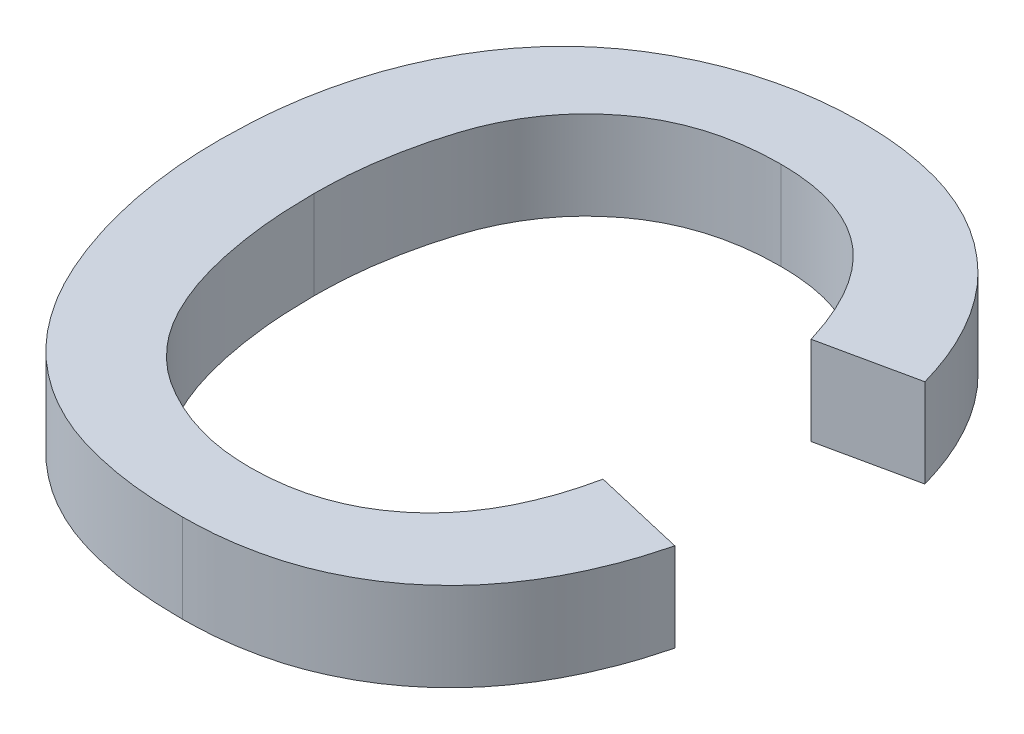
ISO-10303-21;
HEADER;
FILE_DESCRIPTION(('STEP AP214'),'2;1');
FILE_NAME('part.step','',(''),(''),'','','');
FILE_SCHEMA(('AUTOMOTIVE_DESIGN { 1 0 10303 214 1 1 1 1 }'));
ENDSEC;
DATA;
#1=APPLICATION_CONTEXT('core data for automotive mechanical design processes');
#2=APPLICATION_PROTOCOL_DEFINITION('international standard','automotive_design',2000,#1);
#3=PRODUCT_CONTEXT('',#1,'mechanical');
#4=PRODUCT('Part','Part','',(#3));
#5=PRODUCT_RELATED_PRODUCT_CATEGORY('part','',(#4));
#6=PRODUCT_DEFINITION_FORMATION('','',#4);
#7=PRODUCT_DEFINITION_CONTEXT('part definition',#1,'design');
#8=PRODUCT_DEFINITION('design','',#6,#7);
#9=PRODUCT_DEFINITION_SHAPE('','',#8);
#10=(LENGTH_UNIT() NAMED_UNIT(*) SI_UNIT(.MILLI.,.METRE.));
#11=(NAMED_UNIT(*) PLANE_ANGLE_UNIT() SI_UNIT($,.RADIAN.));
#12=(NAMED_UNIT(*) SI_UNIT($,.STERADIAN.) SOLID_ANGLE_UNIT());
#13=UNCERTAINTY_MEASURE_WITH_UNIT(LENGTH_MEASURE(1.E-05),#10,'distance_accuracy_value','');
#14=(GEOMETRIC_REPRESENTATION_CONTEXT(3) GLOBAL_UNCERTAINTY_ASSIGNED_CONTEXT((#13)) GLOBAL_UNIT_ASSIGNED_CONTEXT((#10,
#11,#12)) REPRESENTATION_CONTEXT('',''));
#15=CARTESIAN_POINT('',(0.,0.,0.));
#16=DIRECTION('',(0.,0.,1.));
#17=DIRECTION('',(1.,0.,0.));
#18=AXIS2_PLACEMENT_3D('',#15,#16,#17);
#19=CARTESIAN_POINT('',(3.22099514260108,6.40004762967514,-6.88783785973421));
#20=DIRECTION('',(0.,-1.,0.));
#21=DIRECTION('',(0.,0.,-1.));
#22=AXIS2_PLACEMENT_3D('',#19,#20,#21);
#23=PLANE('',#22);
#24=CARTESIAN_POINT('',(3.3525743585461,6.40004762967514,-6.66221628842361));
#25=CARTESIAN_POINT('',(3.34842007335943,6.40004762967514,-6.67519047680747));
#26=CARTESIAN_POINT('',(3.34028885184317,6.40004762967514,-6.70058497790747));
#27=CARTESIAN_POINT('',(3.32585107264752,6.40004762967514,-6.73677665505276));
#28=CARTESIAN_POINT('',(3.31025875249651,6.40004762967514,-6.77037435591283));
#29=CARTESIAN_POINT('',(3.29314046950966,6.40004762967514,-6.80114969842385));
#30=CARTESIAN_POINT('',(3.27445912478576,6.40004762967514,-6.82911005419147));
#31=CARTESIAN_POINT('',(3.25464490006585,6.40004762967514,-6.85459523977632));
#32=CARTESIAN_POINT('',(3.23322306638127,6.40004762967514,-6.87712957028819));
#33=CARTESIAN_POINT('',(3.21062936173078,6.40004762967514,-6.89723263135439));
#34=CARTESIAN_POINT('',(3.18628035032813,6.40004762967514,-6.9143585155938));
#35=CARTESIAN_POINT('',(3.16074687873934,6.40004762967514,-6.92953486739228));
#36=CARTESIAN_POINT('',(3.13349057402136,6.40004762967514,-6.94209098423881));
#37=CARTESIAN_POINT('',(3.10490353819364,6.40004762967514,-6.95271086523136));
#38=CARTESIAN_POINT('',(3.07471857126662,6.40004762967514,-6.96079373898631));
#39=CARTESIAN_POINT('',(3.04305859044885,6.40004762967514,-6.96648035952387));
#40=CARTESIAN_POINT('',(3.00989577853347,6.40004762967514,-6.96977149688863));
#41=CARTESIAN_POINT('',(2.98729718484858,6.40004762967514,-6.97026027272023));
#42=CARTESIAN_POINT('',(2.97577147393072,6.40004762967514,-6.97050955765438));
#43=(BOUNDED_CURVE() B_SPLINE_CURVE(3,(#24,#25,#26,#27,#28,#29,#30,#31,#32,#33,#34,#35,#36,#37,
#38,#39,#40,#41,#42),.UNSPECIFIED.,.F.,.F.) B_SPLINE_CURVE_WITH_KNOTS((4,1,1,1,1,1,1,1,1,1,1,1,
1,1,1,1,4),(0.,0.07723111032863,0.151165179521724,0.220784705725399,0.287149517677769,
0.350632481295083,0.411306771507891,0.46996441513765,0.526707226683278,0.582498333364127,
0.638508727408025,0.694917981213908,0.752420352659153,0.811250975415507,0.871856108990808,
0.934644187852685,1.),
.UNSPECIFIED.) CURVE() GEOMETRIC_REPRESENTATION_ITEM() RATIONAL_B_SPLINE_CURVE((1.,1.,1.,1.,1.,
1.,1.,1.,1.,1.,1.,1.,1.,1.,1.,1.,1.,1.,1.)) REPRESENTATION_ITEM(''));
#44=CARTESIAN_POINT('',(3.3525743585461,6.40004762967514,-6.66221628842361));
#45=VERTEX_POINT('',#44);
#46=CARTESIAN_POINT('',(2.97577147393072,6.40004762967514,-6.97050955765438));
#47=VERTEX_POINT('',#46);
#48=EDGE_CURVE('E335',#45,#47,#43,.T.);
#49=ORIENTED_EDGE('',*,*,#48,.T.);
#50=CARTESIAN_POINT('',(2.97577147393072,6.40004762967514,-6.97050955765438));
#51=CARTESIAN_POINT('',(2.96253890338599,6.40004762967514,-6.97031756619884));
#52=CARTESIAN_POINT('',(2.93651434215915,6.40004762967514,-6.96993997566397));
#53=CARTESIAN_POINT('',(2.89828113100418,6.40004762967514,-6.96580728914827));
#54=CARTESIAN_POINT('',(2.86156395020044,6.40004762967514,-6.95972024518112));
#55=CARTESIAN_POINT('',(2.82663645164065,6.40004762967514,-6.95059219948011));
#56=CARTESIAN_POINT('',(2.79330750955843,6.40004762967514,-6.93921190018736));
#57=CARTESIAN_POINT('',(2.76177490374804,6.40004762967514,-6.92504141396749));
#58=CARTESIAN_POINT('',(2.73177040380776,6.40004762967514,-6.90843194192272));
#59=CARTESIAN_POINT('',(2.7036288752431,6.40004762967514,-6.88928374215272));
#60=CARTESIAN_POINT('',(2.67758682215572,6.40004762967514,-6.8677574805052));
#61=CARTESIAN_POINT('',(2.6529375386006,6.40004762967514,-6.84500085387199));
#62=CARTESIAN_POINT('',(2.63086446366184,6.40004762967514,-6.81995254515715));
#63=CARTESIAN_POINT('',(2.61052588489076,6.40004762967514,-6.79343849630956));
#64=CARTESIAN_POINT('',(2.59251406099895,6.40004762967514,-6.76499018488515));
#65=CARTESIAN_POINT('',(2.57630040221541,6.40004762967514,-6.73499511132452));
#66=CARTESIAN_POINT('',(2.56198825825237,6.40004762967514,-6.70320744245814));
#67=CARTESIAN_POINT('',(2.54638704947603,6.40004762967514,-6.65846870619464));
#68=CARTESIAN_POINT('',(2.53047952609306,6.40004762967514,-6.60084624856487));
#69=CARTESIAN_POINT('',(2.5166797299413,6.40004762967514,-6.53033503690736));
#70=CARTESIAN_POINT('',(2.50788958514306,6.40004762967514,-6.45871292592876));
#71=CARTESIAN_POINT('',(2.50691123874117,6.40004762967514,-6.41053858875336));
#72=CARTESIAN_POINT('',(2.50642051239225,6.40004762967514,-6.38637494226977));
#73=(BOUNDED_CURVE() B_SPLINE_CURVE(3,(#50,#51,#52,#53,#54,#55,#56,#57,#58,#59,#60,#61,#62,#63,
#64,#65,#66,#67,#68,#69,#70,#71,#72),.UNSPECIFIED.,.F.,.F.) B_SPLINE_CURVE_WITH_KNOTS((4,1,1,1,
1,1,1,1,1,1,1,1,1,1,1,1,1,1,1,1,4),(0.,0.0467628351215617,0.0919686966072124,0.135804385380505,
0.178231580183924,0.219441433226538,0.260176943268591,0.300279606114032,0.340547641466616,
0.380311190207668,0.419641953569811,0.459017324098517,0.498181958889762,0.537670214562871,
0.577913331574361,0.618648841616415,0.660761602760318,0.74529917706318,0.829744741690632,
0.914602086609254,1.),
.UNSPECIFIED.) CURVE() GEOMETRIC_REPRESENTATION_ITEM() RATIONAL_B_SPLINE_CURVE((1.,1.,1.,1.,1.,
1.,1.,1.,1.,1.,1.,1.,1.,1.,1.,1.,1.,1.,1.,1.,1.,1.,1.)) REPRESENTATION_ITEM(''));
#74=CARTESIAN_POINT('',(2.50642051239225,6.40004762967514,-6.38637494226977));
#75=VERTEX_POINT('',#74);
#76=EDGE_CURVE('E26',#47,#75,#73,.T.);
#77=ORIENTED_EDGE('',*,*,#76,.T.);
#78=CARTESIAN_POINT('',(2.50642051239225,6.40004762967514,-6.38637494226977));
#79=CARTESIAN_POINT('',(2.5069739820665,6.40004762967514,-6.35599320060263));
#80=CARTESIAN_POINT('',(2.50804776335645,6.40004762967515,-6.29704987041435));
#81=CARTESIAN_POINT('',(2.51864334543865,6.40004762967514,-6.21163124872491));
#82=CARTESIAN_POINT('',(2.53479776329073,6.40004762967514,-6.13195866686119));
#83=CARTESIAN_POINT('',(2.55429381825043,6.40004762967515,-6.06979817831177));
#84=CARTESIAN_POINT('',(2.57385032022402,6.40004762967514,-6.02394743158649));
#85=CARTESIAN_POINT('',(2.58966663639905,6.40004762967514,-5.99183749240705));
#86=CARTESIAN_POINT('',(2.6077203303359,6.40004762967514,-5.96212451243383));
#87=CARTESIAN_POINT('',(2.62756234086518,6.40004762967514,-5.93463974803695));
#88=CARTESIAN_POINT('',(2.64944825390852,6.40004762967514,-5.90946337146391));
#89=CARTESIAN_POINT('',(2.67307315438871,6.40004762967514,-5.88646164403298));
#90=CARTESIAN_POINT('',(2.69844231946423,6.40004762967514,-5.86541323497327));
#91=CARTESIAN_POINT('',(2.72585635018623,6.40004762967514,-5.84730345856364));
#92=CARTESIAN_POINT('',(2.75426004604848,6.40004762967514,-5.83122355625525));
#93=CARTESIAN_POINT('',(2.78329497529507,6.40004762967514,-5.81692500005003));
#94=CARTESIAN_POINT('',(2.81297941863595,6.40004762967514,-5.8048319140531));
#95=CARTESIAN_POINT('',(2.84343314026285,6.40004762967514,-5.7954377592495));
#96=CARTESIAN_POINT('',(2.874228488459,6.40004762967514,-5.78731990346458));
#97=CARTESIAN_POINT('',(2.90570464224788,6.40004762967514,-5.78201693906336));
#98=CARTESIAN_POINT('',(2.937852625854,6.40004762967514,-5.77902411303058));
#99=CARTESIAN_POINT('',(2.95943920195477,6.40004762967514,-5.7784781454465));
#100=CARTESIAN_POINT('',(2.97036282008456,6.40004762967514,-5.77820186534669));
#101=(BOUNDED_CURVE() B_SPLINE_CURVE(3,(#78,#79,#80,#81,#82,#83,#84,#85,#86,#87,#88,#89,#90,#91,
#92,#93,#94,#95,#96,#97,#98,#99,#100),.UNSPECIFIED.,.F.,.F.) B_SPLINE_CURVE_WITH_KNOTS((4,1,1,1,
1,1,1,1,1,1,1,1,1,1,1,1,1,1,1,1,4),(0.,0.105343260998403,0.20437546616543,0.298068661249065,
0.387069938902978,0.429725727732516,0.470901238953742,0.511121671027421,0.550178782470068,
0.588354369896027,0.626683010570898,0.664451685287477,0.702514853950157,0.740481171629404,
0.777618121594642,0.814716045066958,0.851526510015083,0.888098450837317,0.925111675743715,
0.96210369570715,1.),
.UNSPECIFIED.) CURVE() GEOMETRIC_REPRESENTATION_ITEM() RATIONAL_B_SPLINE_CURVE((1.,1.,1.,1.,1.,
1.,1.,1.,1.,1.,1.,1.,1.,1.,1.,1.,1.,1.,1.,1.,1.,1.,1.)) REPRESENTATION_ITEM(''));
#102=CARTESIAN_POINT('',(2.97036282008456,6.40004762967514,-5.77820186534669));
#103=VERTEX_POINT('',#102);
#104=EDGE_CURVE('E129',#75,#103,#101,.T.);
#105=ORIENTED_EDGE('',*,*,#104,.T.);
#106=CARTESIAN_POINT('',(2.97036282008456,6.40004762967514,-5.77820186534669));
#107=CARTESIAN_POINT('',(2.98339866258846,6.40004762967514,-5.77847525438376));
#108=CARTESIAN_POINT('',(3.00914906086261,6.40004762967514,-5.7790152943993));
#109=CARTESIAN_POINT('',(3.04690241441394,6.40004762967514,-5.78374229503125));
#110=CARTESIAN_POINT('',(3.08329612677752,6.40004762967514,-5.7907081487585));
#111=CARTESIAN_POINT('',(3.11788929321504,6.40004762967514,-5.80145716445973));
#112=CARTESIAN_POINT('',(3.15114723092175,6.40004762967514,-5.81461807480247));
#113=CARTESIAN_POINT('',(3.18279744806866,6.40004762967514,-5.83084777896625));
#114=CARTESIAN_POINT('',(3.21274040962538,6.40004762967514,-5.85036737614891));
#115=CARTESIAN_POINT('',(3.24132831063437,6.40004762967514,-5.87253004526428));
#116=CARTESIAN_POINT('',(3.26803396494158,6.40004762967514,-5.89774737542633));
#117=CARTESIAN_POINT('',(3.29250826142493,6.40004762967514,-5.92581620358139));
#118=CARTESIAN_POINT('',(3.31446447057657,6.40004762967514,-5.95686449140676));
#119=CARTESIAN_POINT('',(3.33482340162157,6.40004762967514,-5.99039395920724));
#120=CARTESIAN_POINT('',(3.35192864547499,6.40004762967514,-6.02740625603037));
#121=CARTESIAN_POINT('',(3.36777214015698,6.40004762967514,-6.06679820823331));
#122=CARTESIAN_POINT('',(3.38097408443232,6.40004762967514,-6.10921725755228));
#123=CARTESIAN_POINT('',(3.38763377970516,6.40004762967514,-6.13872747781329));
#124=CARTESIAN_POINT('',(3.39103589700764,6.40004762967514,-6.15380282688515));
#125=(BOUNDED_CURVE() B_SPLINE_CURVE(3,(#106,#107,#108,#109,#110,#111,#112,#113,#114,#115,#116,
#117,#118,#119,#120,#121,#122,#123,#124),.UNSPECIFIED.,.F.,.F.) B_SPLINE_CURVE_WITH_KNOTS((4,1,
1,1,1,1,1,1,1,1,1,1,1,1,1,1,4),(0.,0.0633358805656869,0.125110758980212,0.184688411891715,
0.243210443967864,0.300888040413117,0.358370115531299,0.415761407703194,0.474386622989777,
0.533966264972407,0.594007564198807,0.65507240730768,0.718610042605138,0.784374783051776,
0.852991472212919,0.924900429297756,1.),
.UNSPECIFIED.) CURVE() GEOMETRIC_REPRESENTATION_ITEM() RATIONAL_B_SPLINE_CURVE((1.,1.,1.,1.,1.,
1.,1.,1.,1.,1.,1.,1.,1.,1.,1.,1.,1.,1.,1.)) REPRESENTATION_ITEM(''));
#126=CARTESIAN_POINT('',(3.39103589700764,6.40004762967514,-6.15380282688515));
#127=VERTEX_POINT('',#126);
#128=EDGE_CURVE('E141',#103,#127,#125,.T.);
#129=ORIENTED_EDGE('',*,*,#128,.T.);
#130=DIRECTION('',(0.973922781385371,0.,0.226879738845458));
#131=VECTOR('',#130,1.);
#132=CARTESIAN_POINT('',(1.5343164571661,6.40004762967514,-6.58633406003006));
#133=LINE('',#132,#131);
#134=CARTESIAN_POINT('',(3.6025743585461,6.40004762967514,-6.10452398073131));
#135=VERTEX_POINT('',#134);
#136=EDGE_CURVE('E144',#127,#135,#133,.T.);
#137=ORIENTED_EDGE('',*,*,#136,.T.);
#138=CARTESIAN_POINT('',(3.6025743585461,6.40004762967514,-6.10452398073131));
#139=CARTESIAN_POINT('',(3.59727472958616,6.40004762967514,-6.08469706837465));
#140=CARTESIAN_POINT('',(3.58690799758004,6.40004762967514,-6.04591316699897));
#141=CARTESIAN_POINT('',(3.56641170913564,6.40004762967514,-5.99040911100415));
#142=CARTESIAN_POINT('',(3.54340713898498,6.40004762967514,-5.93832092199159));
#143=CARTESIAN_POINT('',(3.51733609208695,6.40004762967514,-5.8897858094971));
#144=CARTESIAN_POINT('',(3.48791322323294,6.40004762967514,-5.84508282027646));
#145=CARTESIAN_POINT('',(3.45591811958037,6.40004762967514,-5.80363743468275));
#146=CARTESIAN_POINT('',(3.42008350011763,6.40004762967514,-5.76631880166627));
#147=CARTESIAN_POINT('',(3.38172417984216,6.40004762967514,-5.732265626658));
#148=CARTESIAN_POINT('',(3.34054148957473,6.40004762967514,-5.70223081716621));
#149=CARTESIAN_POINT('',(3.29703195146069,6.40004762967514,-5.67629520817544));
#150=CARTESIAN_POINT('',(3.2514058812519,6.40004762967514,-5.65422926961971));
#151=CARTESIAN_POINT('',(3.2034788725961,6.40004762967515,-5.63608359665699));
#152=CARTESIAN_POINT('',(3.15321985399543,6.40004762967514,-5.62242742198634));
#153=CARTESIAN_POINT('',(3.10088760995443,6.40004762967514,-5.61247400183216));
#154=CARTESIAN_POINT('',(3.04632954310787,6.40004762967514,-5.60634327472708));
#155=CARTESIAN_POINT('',(3.00914089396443,6.40004762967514,-5.60553614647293));
#156=CARTESIAN_POINT('',(2.99019455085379,6.40004762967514,-5.60512494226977));
#157=(BOUNDED_CURVE() B_SPLINE_CURVE(3,(#138,#139,#140,#141,#142,#143,#144,#145,#146,#147,#148,
#149,#150,#151,#152,#153,#154,#155,#156),.UNSPECIFIED.,.F.,.F.) B_SPLINE_CURVE_WITH_KNOTS((4,1,
1,1,1,1,1,1,1,1,1,1,1,1,1,1,4),(0.,0.0715783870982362,0.140016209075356,0.206197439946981,
0.270156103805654,0.332001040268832,0.392755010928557,0.452579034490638,0.512252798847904,
0.57153225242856,0.63015175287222,0.688769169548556,0.74816390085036,0.808703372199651,
0.87025629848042,0.933900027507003,1.),
.UNSPECIFIED.) CURVE() GEOMETRIC_REPRESENTATION_ITEM() RATIONAL_B_SPLINE_CURVE((1.,1.,1.,1.,1.,
1.,1.,1.,1.,1.,1.,1.,1.,1.,1.,1.,1.,1.,1.)) REPRESENTATION_ITEM(''));
#158=CARTESIAN_POINT('',(2.99019455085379,6.40004762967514,-5.60512494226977));
#159=VERTEX_POINT('',#158);
#160=EDGE_CURVE('E428',#135,#159,#157,.T.);
#161=ORIENTED_EDGE('',*,*,#160,.T.);
#162=CARTESIAN_POINT('',(2.99019455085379,6.40004762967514,-5.60512494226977));
#163=CARTESIAN_POINT('',(2.97075523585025,6.40004762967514,-5.60540736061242));
#164=CARTESIAN_POINT('',(2.93272376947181,6.40004762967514,-5.60595988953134));
#165=CARTESIAN_POINT('',(2.87700986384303,6.40004762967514,-5.61045401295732));
#166=CARTESIAN_POINT('',(2.8240204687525,6.40004762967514,-5.61824837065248));
#167=CARTESIAN_POINT('',(2.77385454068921,6.40004762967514,-5.6290775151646));
#168=CARTESIAN_POINT('',(2.72634322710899,6.40004762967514,-5.64246707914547));
#169=CARTESIAN_POINT('',(2.68168354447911,6.40004762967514,-5.65931233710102));
#170=CARTESIAN_POINT('',(2.63995371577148,6.40004762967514,-5.6794917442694));
#171=CARTESIAN_POINT('',(2.60080565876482,6.40004762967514,-5.70244094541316));
#172=CARTESIAN_POINT('',(2.56440564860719,6.40004762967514,-5.72851227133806));
#173=CARTESIAN_POINT('',(2.5299259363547,6.40004762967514,-5.75700212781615));
#174=CARTESIAN_POINT('',(2.49820357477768,6.40004762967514,-5.7886948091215));
#175=CARTESIAN_POINT('',(2.46844538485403,6.40004762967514,-5.82284202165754));
#176=CARTESIAN_POINT('',(2.44129951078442,6.40004762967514,-5.85989421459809));
#177=CARTESIAN_POINT('',(2.41576724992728,6.40004762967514,-5.89934801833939));
#178=CARTESIAN_POINT('',(2.39309481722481,6.40004762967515,-5.94189860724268));
#179=CARTESIAN_POINT('',(2.37244198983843,6.40004762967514,-5.98675709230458));
#180=CARTESIAN_POINT('',(2.35431456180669,6.40004762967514,-6.03348916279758));
#181=CARTESIAN_POINT('',(2.33827812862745,6.40004762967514,-6.08117173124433));
#182=CARTESIAN_POINT('',(2.32516746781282,6.40004762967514,-6.12989981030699));
#183=CARTESIAN_POINT('',(2.31388003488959,6.40004762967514,-6.17926336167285));
#184=CARTESIAN_POINT('',(2.30568026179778,6.40004762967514,-6.2296777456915));
#185=CARTESIAN_POINT('',(2.29916989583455,6.40004762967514,-6.28076470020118));
#186=CARTESIAN_POINT('',(2.2955903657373,6.40004762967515,-6.33283743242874));
#187=CARTESIAN_POINT('',(2.29511933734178,6.40004762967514,-6.36784034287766));
#188=CARTESIAN_POINT('',(2.29488205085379,6.40004762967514,-6.38547349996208));
#189=(BOUNDED_CURVE() B_SPLINE_CURVE(3,(#162,#163,#164,#165,#166,#167,#168,#169,#170,#171,#172,
#173,#174,#175,#176,#177,#178,#179,#180,#181,#182,#183,#184,#185,#186,#187,#188),.UNSPECIFIED.,
.F.,.F.) B_SPLINE_CURVE_WITH_KNOTS((4,1,1,1,1,1,1,1,1,1,1,1,1,1,1,1,1,1,1,1,1,1,1,1,4),(0.,
0.0491959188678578,0.0962478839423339,0.141348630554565,0.184656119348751,0.226058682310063,
0.266173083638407,0.305289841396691,0.343245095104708,0.380877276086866,0.418495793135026,
0.4563187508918,0.494236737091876,0.533023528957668,0.572473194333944,0.613078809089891,
0.654934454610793,0.697396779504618,0.7398840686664,0.782194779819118,0.825061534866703,
0.867987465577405,0.911410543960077,0.955371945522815,1.),
.UNSPECIFIED.) CURVE() GEOMETRIC_REPRESENTATION_ITEM() RATIONAL_B_SPLINE_CURVE((1.,1.,1.,1.,1.,
1.,1.,1.,1.,1.,1.,1.,1.,1.,1.,1.,1.,1.,1.,1.,1.,1.,1.,1.,1.,1.,1.)) REPRESENTATION_ITEM(''));
#190=CARTESIAN_POINT('',(2.29488205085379,6.40004762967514,-6.38547349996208));
#191=VERTEX_POINT('',#190);
#192=EDGE_CURVE('E375',#159,#191,#189,.T.);
#193=ORIENTED_EDGE('',*,*,#192,.T.);
#194=CARTESIAN_POINT('',(2.29488205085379,6.40004762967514,-6.38547349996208));
#195=CARTESIAN_POINT('',(2.29522142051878,6.40004762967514,-6.40450920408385));
#196=CARTESIAN_POINT('',(2.29589192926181,6.40004762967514,-6.44211894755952));
#197=CARTESIAN_POINT('',(2.2996769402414,6.40004762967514,-6.49761321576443));
#198=CARTESIAN_POINT('',(2.30662863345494,6.40004762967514,-6.55117197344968));
#199=CARTESIAN_POINT('',(2.31628251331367,6.40004762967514,-6.60283045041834));
#200=CARTESIAN_POINT('',(2.3284985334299,6.40004762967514,-6.65263048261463));
#201=CARTESIAN_POINT('',(2.34357784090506,6.40004762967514,-6.70059633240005));
#202=CARTESIAN_POINT('',(2.36132968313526,6.40004762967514,-6.74666662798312));
#203=CARTESIAN_POINT('',(2.38169994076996,6.40004762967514,-6.79089217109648));
#204=CARTESIAN_POINT('',(2.40482395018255,6.40004762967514,-6.83277928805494));
#205=CARTESIAN_POINT('',(2.43001155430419,6.40004762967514,-6.87238752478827));
#206=CARTESIAN_POINT('',(2.45786357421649,6.40004762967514,-6.90906653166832));
#207=CARTESIAN_POINT('',(2.48755423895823,6.40004762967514,-6.94351707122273));
#208=CARTESIAN_POINT('',(2.51982509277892,6.40004762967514,-6.97516550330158));
#209=CARTESIAN_POINT('',(2.55457759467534,6.40004762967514,-7.00408351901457));
#210=CARTESIAN_POINT('',(2.59151191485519,6.40004762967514,-7.03053488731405));
#211=CARTESIAN_POINT('',(2.63062266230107,6.40004762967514,-7.05427404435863));
#212=CARTESIAN_POINT('',(2.67139861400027,6.40004762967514,-7.07510391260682));
#213=CARTESIAN_POINT('',(2.71323411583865,6.40004762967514,-7.09365725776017));
#214=CARTESIAN_POINT('',(2.75629556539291,6.40004762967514,-7.10886424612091));
#215=CARTESIAN_POINT('',(2.80024155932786,6.40004762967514,-7.12150824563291));
#216=CARTESIAN_POINT('',(2.84516670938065,6.40004762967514,-7.13157404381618));
#217=CARTESIAN_POINT('',(2.89117598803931,6.40004762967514,-7.13830507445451));
#218=CARTESIAN_POINT('',(2.93822688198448,6.40004762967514,-7.14269153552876));
#219=CARTESIAN_POINT('',(2.96995226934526,6.40004762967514,-7.14328600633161));
#220=CARTESIAN_POINT('',(2.98598782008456,6.40004762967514,-7.14358648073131));
#221=(BOUNDED_CURVE() B_SPLINE_CURVE(3,(#194,#195,#196,#197,#198,#199,#200,#201,#202,#203,#204,
#205,#206,#207,#208,#209,#210,#211,#212,#213,#214,#215,#216,#217,#218,#219,#220),.UNSPECIFIED.,
.F.,.F.) B_SPLINE_CURVE_WITH_KNOTS((4,1,1,1,1,1,1,1,1,1,1,1,1,1,1,1,1,1,1,1,1,1,1,1,4),(0.,
0.0494014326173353,0.0976047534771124,0.144254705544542,0.189472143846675,0.233915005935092,
0.277237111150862,0.319858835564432,0.36195665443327,0.403485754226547,0.443933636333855,
0.483649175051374,0.522893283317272,0.561858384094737,0.600794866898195,0.640104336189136,
0.679643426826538,0.719399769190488,0.758854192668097,0.798315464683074,0.837802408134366,
0.877468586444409,0.917682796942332,0.958392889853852,1.),
.UNSPECIFIED.) CURVE() GEOMETRIC_REPRESENTATION_ITEM() RATIONAL_B_SPLINE_CURVE((1.,1.,1.,1.,1.,
1.,1.,1.,1.,1.,1.,1.,1.,1.,1.,1.,1.,1.,1.,1.,1.,1.,1.,1.,1.,1.,1.)) REPRESENTATION_ITEM(''));
#222=CARTESIAN_POINT('',(2.98598782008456,6.40004762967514,-7.14358648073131));
#223=VERTEX_POINT('',#222);
#224=EDGE_CURVE('E398',#191,#223,#221,.T.);
#225=ORIENTED_EDGE('',*,*,#224,.T.);
#226=CARTESIAN_POINT('',(2.98598782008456,6.40004762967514,-7.14358648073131));
#227=CARTESIAN_POINT('',(3.00392944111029,6.40004762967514,-7.1432482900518));
#228=CARTESIAN_POINT('',(3.0391954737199,6.40004762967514,-7.14258354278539));
#229=CARTESIAN_POINT('',(3.09094209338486,6.40004762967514,-7.13711586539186));
#230=CARTESIAN_POINT('',(3.14050184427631,6.40004762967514,-7.12795810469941));
#231=CARTESIAN_POINT('',(3.18808947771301,6.40004762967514,-7.11594398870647));
#232=CARTESIAN_POINT('',(3.23321023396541,6.40004762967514,-7.09949416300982));
#233=CARTESIAN_POINT('',(3.27635397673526,6.40004762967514,-7.07993721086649));
#234=CARTESIAN_POINT('',(3.31709151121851,6.40004762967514,-7.05644190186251));
#235=CARTESIAN_POINT('',(3.3557398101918,6.40004762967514,-7.02965392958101));
#236=CARTESIAN_POINT('',(3.39166973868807,6.40004762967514,-6.99952389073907));
#237=CARTESIAN_POINT('',(3.42538409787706,6.40004762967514,-6.96677158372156));
#238=CARTESIAN_POINT('',(3.45550819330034,6.40004762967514,-6.93057843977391));
#239=CARTESIAN_POINT('',(3.48323512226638,6.40004762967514,-6.89182039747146));
#240=CARTESIAN_POINT('',(3.50769250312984,6.40004762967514,-6.84996001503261));
#241=CARTESIAN_POINT('',(3.52978009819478,6.40004762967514,-6.80536227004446));
#242=CARTESIAN_POINT('',(3.54877478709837,6.40004762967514,-6.7576956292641));
#243=CARTESIAN_POINT('',(3.55893789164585,6.40004762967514,-6.72449449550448));
#244=CARTESIAN_POINT('',(3.56411282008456,6.40004762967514,-6.70758888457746));
#245=(BOUNDED_CURVE() B_SPLINE_CURVE(3,(#226,#227,#228,#229,#230,#231,#232,#233,#234,#235,#236,
#237,#238,#239,#240,#241,#242,#243,#244),.UNSPECIFIED.,.F.,.F.) B_SPLINE_CURVE_WITH_KNOTS((4,1,
1,1,1,1,1,1,1,1,1,1,1,1,1,1,4),(0.,0.0686494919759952,0.134937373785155,0.198841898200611,
0.261409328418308,0.322516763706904,0.382376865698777,0.442470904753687,0.50222783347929,
0.562101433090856,0.621731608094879,0.681851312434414,0.742049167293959,0.803908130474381,
0.86716216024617,0.932360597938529,1.),
.UNSPECIFIED.) CURVE() GEOMETRIC_REPRESENTATION_ITEM() RATIONAL_B_SPLINE_CURVE((1.,1.,1.,1.,1.,
1.,1.,1.,1.,1.,1.,1.,1.,1.,1.,1.,1.,1.,1.)) REPRESENTATION_ITEM(''));
#246=CARTESIAN_POINT('',(3.56411282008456,6.40004762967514,-6.70758888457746));
#247=VERTEX_POINT('',#246);
#248=EDGE_CURVE('E352',#223,#247,#245,.T.);
#249=ORIENTED_EDGE('',*,*,#248,.T.);
#250=DIRECTION('',(-0.977761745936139,0.,0.209718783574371));
#251=VECTOR('',#250,1.);
#252=CARTESIAN_POINT('',(-1.21866796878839,6.40004762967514,-5.6817367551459));
#253=LINE('',#252,#251);
#254=EDGE_CURVE('E337',#247,#45,#253,.T.);
#255=ORIENTED_EDGE('',*,*,#254,.T.);
#256=EDGE_LOOP('',(#49,#77,#105,#129,#137,#161,#193,#225,#249,#255));
#257=FACE_BOUND('',#256,.T.);
#258=ADVANCED_FACE('F16',(#257),#23,.T.);
#259=CARTESIAN_POINT('',(3.22099514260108,6.60004762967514,-6.88783785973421));
#260=DIRECTION('',(0.,-1.,0.));
#261=DIRECTION('',(0.,0.,-1.));
#262=AXIS2_PLACEMENT_3D('',#259,#260,#261);
#263=PLANE('',#262);
#264=CARTESIAN_POINT('',(3.3525743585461,6.60004762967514,-6.66221628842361));
#265=CARTESIAN_POINT('',(3.34842007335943,6.60004762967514,-6.67519047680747));
#266=CARTESIAN_POINT('',(3.34028885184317,6.60004762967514,-6.70058497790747));
#267=CARTESIAN_POINT('',(3.32585107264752,6.60004762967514,-6.73677665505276));
#268=CARTESIAN_POINT('',(3.31025875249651,6.60004762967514,-6.77037435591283));
#269=CARTESIAN_POINT('',(3.29314046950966,6.60004762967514,-6.80114969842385));
#270=CARTESIAN_POINT('',(3.27445912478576,6.60004762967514,-6.82911005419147));
#271=CARTESIAN_POINT('',(3.25464490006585,6.60004762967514,-6.85459523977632));
#272=CARTESIAN_POINT('',(3.23322306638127,6.60004762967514,-6.87712957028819));
#273=CARTESIAN_POINT('',(3.21062936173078,6.60004762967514,-6.89723263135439));
#274=CARTESIAN_POINT('',(3.18628035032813,6.60004762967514,-6.9143585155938));
#275=CARTESIAN_POINT('',(3.16074687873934,6.60004762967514,-6.92953486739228));
#276=CARTESIAN_POINT('',(3.13349057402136,6.60004762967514,-6.94209098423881));
#277=CARTESIAN_POINT('',(3.10490353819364,6.60004762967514,-6.95271086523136));
#278=CARTESIAN_POINT('',(3.07471857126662,6.60004762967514,-6.96079373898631));
#279=CARTESIAN_POINT('',(3.04305859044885,6.60004762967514,-6.96648035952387));
#280=CARTESIAN_POINT('',(3.00989577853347,6.60004762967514,-6.96977149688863));
#281=CARTESIAN_POINT('',(2.98729718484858,6.60004762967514,-6.97026027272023));
#282=CARTESIAN_POINT('',(2.97577147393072,6.60004762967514,-6.97050955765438));
#283=(BOUNDED_CURVE() B_SPLINE_CURVE(3,(#264,#265,#266,#267,#268,#269,#270,#271,#272,#273,#274,
#275,#276,#277,#278,#279,#280,#281,#282),.UNSPECIFIED.,.F.,.F.) B_SPLINE_CURVE_WITH_KNOTS((4,1,
1,1,1,1,1,1,1,1,1,1,1,1,1,1,4),(0.,0.07723111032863,0.151165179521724,0.220784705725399,
0.287149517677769,0.350632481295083,0.411306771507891,0.46996441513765,0.526707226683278,
0.582498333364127,0.638508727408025,0.694917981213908,0.752420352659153,0.811250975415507,
0.871856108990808,0.934644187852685,1.),
.UNSPECIFIED.) CURVE() GEOMETRIC_REPRESENTATION_ITEM() RATIONAL_B_SPLINE_CURVE((1.,1.,1.,1.,1.,
1.,1.,1.,1.,1.,1.,1.,1.,1.,1.,1.,1.,1.,1.)) REPRESENTATION_ITEM(''));
#284=CARTESIAN_POINT('',(3.3525743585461,6.60004762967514,-6.66221628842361));
#285=VERTEX_POINT('',#284);
#286=CARTESIAN_POINT('',(2.97577147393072,6.60004762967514,-6.97050955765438));
#287=VERTEX_POINT('',#286);
#288=EDGE_CURVE('E347',#285,#287,#283,.T.);
#289=ORIENTED_EDGE('',*,*,#288,.F.);
#290=DIRECTION('',(-0.977761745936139,0.,0.209718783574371));
#291=VECTOR('',#290,1.);
#292=CARTESIAN_POINT('',(-1.21866796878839,6.60004762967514,-5.6817367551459));
#293=LINE('',#292,#291);
#294=CARTESIAN_POINT('',(3.56411282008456,6.60004762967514,-6.70758888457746));
#295=VERTEX_POINT('',#294);
#296=EDGE_CURVE('E372',#295,#285,#293,.T.);
#297=ORIENTED_EDGE('',*,*,#296,.F.);
#298=CARTESIAN_POINT('',(2.98598782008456,6.60004762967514,-7.14358648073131));
#299=CARTESIAN_POINT('',(3.00392944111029,6.60004762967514,-7.1432482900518));
#300=CARTESIAN_POINT('',(3.0391954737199,6.60004762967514,-7.14258354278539));
#301=CARTESIAN_POINT('',(3.09094209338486,6.60004762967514,-7.13711586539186));
#302=CARTESIAN_POINT('',(3.14050184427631,6.60004762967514,-7.12795810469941));
#303=CARTESIAN_POINT('',(3.18808947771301,6.60004762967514,-7.11594398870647));
#304=CARTESIAN_POINT('',(3.23321023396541,6.60004762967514,-7.09949416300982));
#305=CARTESIAN_POINT('',(3.27635397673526,6.60004762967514,-7.07993721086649));
#306=CARTESIAN_POINT('',(3.31709151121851,6.60004762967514,-7.05644190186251));
#307=CARTESIAN_POINT('',(3.3557398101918,6.60004762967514,-7.02965392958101));
#308=CARTESIAN_POINT('',(3.39166973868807,6.60004762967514,-6.99952389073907));
#309=CARTESIAN_POINT('',(3.42538409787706,6.60004762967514,-6.96677158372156));
#310=CARTESIAN_POINT('',(3.45550819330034,6.60004762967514,-6.93057843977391));
#311=CARTESIAN_POINT('',(3.48323512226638,6.60004762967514,-6.89182039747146));
#312=CARTESIAN_POINT('',(3.50769250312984,6.60004762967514,-6.84996001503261));
#313=CARTESIAN_POINT('',(3.52978009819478,6.60004762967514,-6.80536227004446));
#314=CARTESIAN_POINT('',(3.54877478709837,6.60004762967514,-6.7576956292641));
#315=CARTESIAN_POINT('',(3.55893789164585,6.60004762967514,-6.72449449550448));
#316=CARTESIAN_POINT('',(3.56411282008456,6.60004762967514,-6.70758888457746));
#317=(BOUNDED_CURVE() B_SPLINE_CURVE(3,(#298,#299,#300,#301,#302,#303,#304,#305,#306,#307,#308,
#309,#310,#311,#312,#313,#314,#315,#316),.UNSPECIFIED.,.F.,.F.) B_SPLINE_CURVE_WITH_KNOTS((4,1,
1,1,1,1,1,1,1,1,1,1,1,1,1,1,4),(0.,0.0686494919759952,0.134937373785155,0.198841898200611,
0.261409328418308,0.322516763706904,0.382376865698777,0.442470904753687,0.50222783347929,
0.562101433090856,0.621731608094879,0.681851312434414,0.742049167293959,0.803908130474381,
0.86716216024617,0.932360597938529,1.),
.UNSPECIFIED.) CURVE() GEOMETRIC_REPRESENTATION_ITEM() RATIONAL_B_SPLINE_CURVE((1.,1.,1.,1.,1.,
1.,1.,1.,1.,1.,1.,1.,1.,1.,1.,1.,1.,1.,1.)) REPRESENTATION_ITEM(''));
#318=CARTESIAN_POINT('',(2.98598782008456,6.60004762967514,-7.14358648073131));
#319=VERTEX_POINT('',#318);
#320=EDGE_CURVE('E393',#319,#295,#317,.T.);
#321=ORIENTED_EDGE('',*,*,#320,.F.);
#322=CARTESIAN_POINT('',(2.29488205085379,6.60004762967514,-6.38547349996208));
#323=CARTESIAN_POINT('',(2.29522142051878,6.60004762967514,-6.40450920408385));
#324=CARTESIAN_POINT('',(2.29589192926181,6.60004762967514,-6.44211894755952));
#325=CARTESIAN_POINT('',(2.2996769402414,6.60004762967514,-6.49761321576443));
#326=CARTESIAN_POINT('',(2.30662863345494,6.60004762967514,-6.55117197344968));
#327=CARTESIAN_POINT('',(2.31628251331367,6.60004762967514,-6.60283045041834));
#328=CARTESIAN_POINT('',(2.3284985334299,6.60004762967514,-6.65263048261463));
#329=CARTESIAN_POINT('',(2.34357784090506,6.60004762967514,-6.70059633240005));
#330=CARTESIAN_POINT('',(2.36132968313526,6.60004762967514,-6.74666662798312));
#331=CARTESIAN_POINT('',(2.38169994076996,6.60004762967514,-6.79089217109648));
#332=CARTESIAN_POINT('',(2.40482395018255,6.60004762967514,-6.83277928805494));
#333=CARTESIAN_POINT('',(2.43001155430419,6.60004762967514,-6.87238752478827));
#334=CARTESIAN_POINT('',(2.45786357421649,6.60004762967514,-6.90906653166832));
#335=CARTESIAN_POINT('',(2.48755423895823,6.60004762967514,-6.94351707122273));
#336=CARTESIAN_POINT('',(2.51982509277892,6.60004762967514,-6.97516550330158));
#337=CARTESIAN_POINT('',(2.55457759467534,6.60004762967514,-7.00408351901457));
#338=CARTESIAN_POINT('',(2.59151191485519,6.60004762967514,-7.03053488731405));
#339=CARTESIAN_POINT('',(2.63062266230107,6.60004762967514,-7.05427404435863));
#340=CARTESIAN_POINT('',(2.67139861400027,6.60004762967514,-7.07510391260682));
#341=CARTESIAN_POINT('',(2.71323411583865,6.60004762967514,-7.09365725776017));
#342=CARTESIAN_POINT('',(2.75629556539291,6.60004762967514,-7.10886424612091));
#343=CARTESIAN_POINT('',(2.80024155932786,6.60004762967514,-7.12150824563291));
#344=CARTESIAN_POINT('',(2.84516670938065,6.60004762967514,-7.13157404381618));
#345=CARTESIAN_POINT('',(2.89117598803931,6.60004762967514,-7.13830507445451));
#346=CARTESIAN_POINT('',(2.93822688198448,6.60004762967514,-7.14269153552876));
#347=CARTESIAN_POINT('',(2.96995226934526,6.60004762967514,-7.14328600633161));
#348=CARTESIAN_POINT('',(2.98598782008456,6.60004762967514,-7.14358648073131));
#349=(BOUNDED_CURVE() B_SPLINE_CURVE(3,(#322,#323,#324,#325,#326,#327,#328,#329,#330,#331,#332,
#333,#334,#335,#336,#337,#338,#339,#340,#341,#342,#343,#344,#345,#346,#347,#348),.UNSPECIFIED.,
.F.,.F.) B_SPLINE_CURVE_WITH_KNOTS((4,1,1,1,1,1,1,1,1,1,1,1,1,1,1,1,1,1,1,1,1,1,1,1,4),(0.,
0.0494014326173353,0.0976047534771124,0.144254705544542,0.189472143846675,0.233915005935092,
0.277237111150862,0.319858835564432,0.36195665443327,0.403485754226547,0.443933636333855,
0.483649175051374,0.522893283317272,0.561858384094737,0.600794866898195,0.640104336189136,
0.679643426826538,0.719399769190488,0.758854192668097,0.798315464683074,0.837802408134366,
0.877468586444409,0.917682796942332,0.958392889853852,1.),
.UNSPECIFIED.) CURVE() GEOMETRIC_REPRESENTATION_ITEM() RATIONAL_B_SPLINE_CURVE((1.,1.,1.,1.,1.,
1.,1.,1.,1.,1.,1.,1.,1.,1.,1.,1.,1.,1.,1.,1.,1.,1.,1.,1.,1.,1.,1.)) REPRESENTATION_ITEM(''));
#350=CARTESIAN_POINT('',(2.29488205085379,6.60004762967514,-6.38547349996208));
#351=VERTEX_POINT('',#350);
#352=EDGE_CURVE('E381',#351,#319,#349,.T.);
#353=ORIENTED_EDGE('',*,*,#352,.F.);
#354=CARTESIAN_POINT('',(2.99019455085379,6.60004762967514,-5.60512494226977));
#355=CARTESIAN_POINT('',(2.97075523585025,6.60004762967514,-5.60540736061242));
#356=CARTESIAN_POINT('',(2.93272376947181,6.60004762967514,-5.60595988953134));
#357=CARTESIAN_POINT('',(2.87700986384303,6.60004762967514,-5.61045401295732));
#358=CARTESIAN_POINT('',(2.8240204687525,6.60004762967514,-5.61824837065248));
#359=CARTESIAN_POINT('',(2.77385454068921,6.60004762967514,-5.6290775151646));
#360=CARTESIAN_POINT('',(2.72634322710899,6.60004762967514,-5.64246707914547));
#361=CARTESIAN_POINT('',(2.68168354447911,6.60004762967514,-5.65931233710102));
#362=CARTESIAN_POINT('',(2.63995371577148,6.60004762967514,-5.6794917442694));
#363=CARTESIAN_POINT('',(2.60080565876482,6.60004762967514,-5.70244094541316));
#364=CARTESIAN_POINT('',(2.56440564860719,6.60004762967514,-5.72851227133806));
#365=CARTESIAN_POINT('',(2.5299259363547,6.60004762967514,-5.75700212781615));
#366=CARTESIAN_POINT('',(2.49820357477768,6.60004762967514,-5.7886948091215));
#367=CARTESIAN_POINT('',(2.46844538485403,6.60004762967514,-5.82284202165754));
#368=CARTESIAN_POINT('',(2.44129951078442,6.60004762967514,-5.85989421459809));
#369=CARTESIAN_POINT('',(2.41576724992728,6.60004762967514,-5.89934801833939));
#370=CARTESIAN_POINT('',(2.39309481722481,6.60004762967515,-5.94189860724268));
#371=CARTESIAN_POINT('',(2.37244198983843,6.60004762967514,-5.98675709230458));
#372=CARTESIAN_POINT('',(2.35431456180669,6.60004762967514,-6.03348916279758));
#373=CARTESIAN_POINT('',(2.33827812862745,6.60004762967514,-6.08117173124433));
#374=CARTESIAN_POINT('',(2.32516746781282,6.60004762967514,-6.12989981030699));
#375=CARTESIAN_POINT('',(2.31388003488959,6.60004762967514,-6.17926336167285));
#376=CARTESIAN_POINT('',(2.30568026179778,6.60004762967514,-6.2296777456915));
#377=CARTESIAN_POINT('',(2.29916989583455,6.60004762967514,-6.28076470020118));
#378=CARTESIAN_POINT('',(2.2955903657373,6.60004762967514,-6.33283743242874));
#379=CARTESIAN_POINT('',(2.29511933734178,6.60004762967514,-6.36784034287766));
#380=CARTESIAN_POINT('',(2.29488205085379,6.60004762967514,-6.38547349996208));
#381=(BOUNDED_CURVE() B_SPLINE_CURVE(3,(#354,#355,#356,#357,#358,#359,#360,#361,#362,#363,#364,
#365,#366,#367,#368,#369,#370,#371,#372,#373,#374,#375,#376,#377,#378,#379,#380),.UNSPECIFIED.,
.F.,.F.) B_SPLINE_CURVE_WITH_KNOTS((4,1,1,1,1,1,1,1,1,1,1,1,1,1,1,1,1,1,1,1,1,1,1,1,4),(0.,
0.0491959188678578,0.0962478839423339,0.141348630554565,0.184656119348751,0.226058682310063,
0.266173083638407,0.305289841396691,0.343245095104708,0.380877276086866,0.418495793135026,
0.4563187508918,0.494236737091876,0.533023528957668,0.572473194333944,0.613078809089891,
0.654934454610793,0.697396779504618,0.7398840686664,0.782194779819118,0.825061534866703,
0.867987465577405,0.911410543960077,0.955371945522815,1.),
.UNSPECIFIED.) CURVE() GEOMETRIC_REPRESENTATION_ITEM() RATIONAL_B_SPLINE_CURVE((1.,1.,1.,1.,1.,
1.,1.,1.,1.,1.,1.,1.,1.,1.,1.,1.,1.,1.,1.,1.,1.,1.,1.,1.,1.,1.,1.)) REPRESENTATION_ITEM(''));
#382=CARTESIAN_POINT('',(2.99019455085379,6.60004762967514,-5.60512494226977));
#383=VERTEX_POINT('',#382);
#384=EDGE_CURVE('E423',#383,#351,#381,.T.);
#385=ORIENTED_EDGE('',*,*,#384,.F.);
#386=CARTESIAN_POINT('',(3.6025743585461,6.60004762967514,-6.10452398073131));
#387=CARTESIAN_POINT('',(3.59727472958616,6.60004762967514,-6.08469706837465));
#388=CARTESIAN_POINT('',(3.58690799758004,6.60004762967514,-6.04591316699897));
#389=CARTESIAN_POINT('',(3.56641170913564,6.60004762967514,-5.99040911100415));
#390=CARTESIAN_POINT('',(3.54340713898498,6.60004762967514,-5.93832092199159));
#391=CARTESIAN_POINT('',(3.51733609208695,6.60004762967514,-5.8897858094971));
#392=CARTESIAN_POINT('',(3.48791322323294,6.60004762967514,-5.84508282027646));
#393=CARTESIAN_POINT('',(3.45591811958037,6.60004762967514,-5.80363743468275));
#394=CARTESIAN_POINT('',(3.42008350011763,6.60004762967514,-5.76631880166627));
#395=CARTESIAN_POINT('',(3.38172417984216,6.60004762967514,-5.732265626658));
#396=CARTESIAN_POINT('',(3.34054148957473,6.60004762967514,-5.70223081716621));
#397=CARTESIAN_POINT('',(3.29703195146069,6.60004762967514,-5.67629520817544));
#398=CARTESIAN_POINT('',(3.2514058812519,6.60004762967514,-5.65422926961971));
#399=CARTESIAN_POINT('',(3.2034788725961,6.60004762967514,-5.63608359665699));
#400=CARTESIAN_POINT('',(3.15321985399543,6.60004762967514,-5.62242742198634));
#401=CARTESIAN_POINT('',(3.10088760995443,6.60004762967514,-5.61247400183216));
#402=CARTESIAN_POINT('',(3.04632954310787,6.60004762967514,-5.60634327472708));
#403=CARTESIAN_POINT('',(3.00914089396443,6.60004762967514,-5.60553614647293));
#404=CARTESIAN_POINT('',(2.99019455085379,6.60004762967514,-5.60512494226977));
#405=(BOUNDED_CURVE() B_SPLINE_CURVE(3,(#386,#387,#388,#389,#390,#391,#392,#393,#394,#395,#396,
#397,#398,#399,#400,#401,#402,#403,#404),.UNSPECIFIED.,.F.,.F.) B_SPLINE_CURVE_WITH_KNOTS((4,1,
1,1,1,1,1,1,1,1,1,1,1,1,1,1,4),(0.,0.0715783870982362,0.140016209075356,0.206197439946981,
0.270156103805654,0.332001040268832,0.392755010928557,0.452579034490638,0.512252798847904,
0.57153225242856,0.63015175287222,0.688769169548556,0.74816390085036,0.808703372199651,
0.87025629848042,0.933900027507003,1.),
.UNSPECIFIED.) CURVE() GEOMETRIC_REPRESENTATION_ITEM() RATIONAL_B_SPLINE_CURVE((1.,1.,1.,1.,1.,
1.,1.,1.,1.,1.,1.,1.,1.,1.,1.,1.,1.,1.,1.)) REPRESENTATION_ITEM(''));
#406=CARTESIAN_POINT('',(3.6025743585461,6.60004762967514,-6.10452398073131));
#407=VERTEX_POINT('',#406);
#408=EDGE_CURVE('E136',#407,#383,#405,.T.);
#409=ORIENTED_EDGE('',*,*,#408,.F.);
#410=DIRECTION('',(0.973922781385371,0.,0.226879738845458));
#411=VECTOR('',#410,1.);
#412=CARTESIAN_POINT('',(1.5343164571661,6.60004762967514,-6.58633406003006));
#413=LINE('',#412,#411);
#414=CARTESIAN_POINT('',(3.39103589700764,6.60004762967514,-6.15380282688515));
#415=VERTEX_POINT('',#414);
#416=EDGE_CURVE('E132',#415,#407,#413,.T.);
#417=ORIENTED_EDGE('',*,*,#416,.F.);
#418=CARTESIAN_POINT('',(2.97036282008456,6.60004762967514,-5.77820186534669));
#419=CARTESIAN_POINT('',(2.98339866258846,6.60004762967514,-5.77847525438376));
#420=CARTESIAN_POINT('',(3.00914906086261,6.60004762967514,-5.7790152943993));
#421=CARTESIAN_POINT('',(3.04690241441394,6.60004762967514,-5.78374229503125));
#422=CARTESIAN_POINT('',(3.08329612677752,6.60004762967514,-5.7907081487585));
#423=CARTESIAN_POINT('',(3.11788929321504,6.60004762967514,-5.80145716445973));
#424=CARTESIAN_POINT('',(3.15114723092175,6.60004762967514,-5.81461807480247));
#425=CARTESIAN_POINT('',(3.18279744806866,6.60004762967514,-5.83084777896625));
#426=CARTESIAN_POINT('',(3.21274040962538,6.60004762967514,-5.85036737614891));
#427=CARTESIAN_POINT('',(3.24132831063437,6.60004762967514,-5.87253004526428));
#428=CARTESIAN_POINT('',(3.26803396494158,6.60004762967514,-5.89774737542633));
#429=CARTESIAN_POINT('',(3.29250826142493,6.60004762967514,-5.92581620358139));
#430=CARTESIAN_POINT('',(3.31446447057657,6.60004762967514,-5.95686449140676));
#431=CARTESIAN_POINT('',(3.33482340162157,6.60004762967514,-5.99039395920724));
#432=CARTESIAN_POINT('',(3.35192864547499,6.60004762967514,-6.02740625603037));
#433=CARTESIAN_POINT('',(3.36777214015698,6.60004762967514,-6.06679820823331));
#434=CARTESIAN_POINT('',(3.38097408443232,6.60004762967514,-6.10921725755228));
#435=CARTESIAN_POINT('',(3.38763377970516,6.60004762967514,-6.13872747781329));
#436=CARTESIAN_POINT('',(3.39103589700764,6.60004762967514,-6.15380282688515));
#437=(BOUNDED_CURVE() B_SPLINE_CURVE(3,(#418,#419,#420,#421,#422,#423,#424,#425,#426,#427,#428,
#429,#430,#431,#432,#433,#434,#435,#436),.UNSPECIFIED.,.F.,.F.) B_SPLINE_CURVE_WITH_KNOTS((4,1,
1,1,1,1,1,1,1,1,1,1,1,1,1,1,4),(0.,0.0633358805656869,0.125110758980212,0.184688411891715,
0.243210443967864,0.300888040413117,0.358370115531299,0.415761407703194,0.474386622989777,
0.533966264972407,0.594007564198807,0.65507240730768,0.718610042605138,0.784374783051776,
0.852991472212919,0.924900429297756,1.),
.UNSPECIFIED.) CURVE() GEOMETRIC_REPRESENTATION_ITEM() RATIONAL_B_SPLINE_CURVE((1.,1.,1.,1.,1.,
1.,1.,1.,1.,1.,1.,1.,1.,1.,1.,1.,1.,1.,1.)) REPRESENTATION_ITEM(''));
#438=CARTESIAN_POINT('',(2.97036282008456,6.60004762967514,-5.77820186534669));
#439=VERTEX_POINT('',#438);
#440=EDGE_CURVE('E118',#439,#415,#437,.T.);
#441=ORIENTED_EDGE('',*,*,#440,.F.);
#442=CARTESIAN_POINT('',(2.50642051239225,6.60004762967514,-6.38637494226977));
#443=CARTESIAN_POINT('',(2.5069739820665,6.60004762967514,-6.35599320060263));
#444=CARTESIAN_POINT('',(2.50804776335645,6.60004762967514,-6.29704987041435));
#445=CARTESIAN_POINT('',(2.51864334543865,6.60004762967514,-6.21163124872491));
#446=CARTESIAN_POINT('',(2.53479776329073,6.60004762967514,-6.13195866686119));
#447=CARTESIAN_POINT('',(2.55429381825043,6.60004762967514,-6.06979817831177));
#448=CARTESIAN_POINT('',(2.57385032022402,6.60004762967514,-6.02394743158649));
#449=CARTESIAN_POINT('',(2.58966663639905,6.60004762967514,-5.99183749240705));
#450=CARTESIAN_POINT('',(2.6077203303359,6.60004762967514,-5.96212451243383));
#451=CARTESIAN_POINT('',(2.62756234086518,6.60004762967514,-5.93463974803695));
#452=CARTESIAN_POINT('',(2.64944825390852,6.60004762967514,-5.90946337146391));
#453=CARTESIAN_POINT('',(2.67307315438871,6.60004762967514,-5.88646164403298));
#454=CARTESIAN_POINT('',(2.69844231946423,6.60004762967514,-5.86541323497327));
#455=CARTESIAN_POINT('',(2.72585635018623,6.60004762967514,-5.84730345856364));
#456=CARTESIAN_POINT('',(2.75426004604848,6.60004762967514,-5.83122355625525));
#457=CARTESIAN_POINT('',(2.78329497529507,6.60004762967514,-5.81692500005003));
#458=CARTESIAN_POINT('',(2.81297941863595,6.60004762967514,-5.8048319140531));
#459=CARTESIAN_POINT('',(2.84343314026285,6.60004762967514,-5.7954377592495));
#460=CARTESIAN_POINT('',(2.874228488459,6.60004762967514,-5.78731990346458));
#461=CARTESIAN_POINT('',(2.90570464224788,6.60004762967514,-5.78201693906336));
#462=CARTESIAN_POINT('',(2.937852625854,6.60004762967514,-5.77902411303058));
#463=CARTESIAN_POINT('',(2.95943920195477,6.60004762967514,-5.7784781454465));
#464=CARTESIAN_POINT('',(2.97036282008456,6.60004762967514,-5.77820186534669));
#465=(BOUNDED_CURVE() B_SPLINE_CURVE(3,(#442,#443,#444,#445,#446,#447,#448,#449,#450,#451,#452,
#453,#454,#455,#456,#457,#458,#459,#460,#461,#462,#463,#464),.UNSPECIFIED.,.F.,
.F.) B_SPLINE_CURVE_WITH_KNOTS((4,1,1,1,1,1,1,1,1,1,1,1,1,1,1,1,1,1,1,1,4),(0.,
0.105343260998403,0.20437546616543,0.298068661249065,0.387069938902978,0.429725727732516,
0.470901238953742,0.511121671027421,0.550178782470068,0.588354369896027,0.626683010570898,
0.664451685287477,0.702514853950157,0.740481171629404,0.777618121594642,0.814716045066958,
0.851526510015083,0.888098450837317,0.925111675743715,0.96210369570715,1.),
.UNSPECIFIED.) CURVE() GEOMETRIC_REPRESENTATION_ITEM() RATIONAL_B_SPLINE_CURVE((1.,1.,1.,1.,1.,
1.,1.,1.,1.,1.,1.,1.,1.,1.,1.,1.,1.,1.,1.,1.,1.,1.,1.)) REPRESENTATION_ITEM(''));
#466=CARTESIAN_POINT('',(2.50642051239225,6.60004762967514,-6.38637494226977));
#467=VERTEX_POINT('',#466);
#468=EDGE_CURVE('E176',#467,#439,#465,.T.);
#469=ORIENTED_EDGE('',*,*,#468,.F.);
#470=CARTESIAN_POINT('',(2.97577147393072,6.60004762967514,-6.97050955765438));
#471=CARTESIAN_POINT('',(2.96253890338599,6.60004762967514,-6.97031756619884));
#472=CARTESIAN_POINT('',(2.93651434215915,6.60004762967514,-6.96993997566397));
#473=CARTESIAN_POINT('',(2.89828113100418,6.60004762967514,-6.96580728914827));
#474=CARTESIAN_POINT('',(2.86156395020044,6.60004762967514,-6.95972024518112));
#475=CARTESIAN_POINT('',(2.82663645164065,6.60004762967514,-6.95059219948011));
#476=CARTESIAN_POINT('',(2.79330750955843,6.60004762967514,-6.93921190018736));
#477=CARTESIAN_POINT('',(2.76177490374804,6.60004762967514,-6.92504141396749));
#478=CARTESIAN_POINT('',(2.73177040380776,6.60004762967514,-6.90843194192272));
#479=CARTESIAN_POINT('',(2.7036288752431,6.60004762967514,-6.88928374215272));
#480=CARTESIAN_POINT('',(2.67758682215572,6.60004762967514,-6.8677574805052));
#481=CARTESIAN_POINT('',(2.6529375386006,6.60004762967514,-6.84500085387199));
#482=CARTESIAN_POINT('',(2.63086446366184,6.60004762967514,-6.81995254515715));
#483=CARTESIAN_POINT('',(2.61052588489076,6.60004762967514,-6.79343849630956));
#484=CARTESIAN_POINT('',(2.59251406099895,6.60004762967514,-6.76499018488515));
#485=CARTESIAN_POINT('',(2.57630040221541,6.60004762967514,-6.73499511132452));
#486=CARTESIAN_POINT('',(2.56198825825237,6.60004762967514,-6.70320744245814));
#487=CARTESIAN_POINT('',(2.54638704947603,6.60004762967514,-6.65846870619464));
#488=CARTESIAN_POINT('',(2.53047952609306,6.60004762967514,-6.60084624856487));
#489=CARTESIAN_POINT('',(2.5166797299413,6.60004762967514,-6.53033503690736));
#490=CARTESIAN_POINT('',(2.50788958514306,6.60004762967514,-6.45871292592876));
#491=CARTESIAN_POINT('',(2.50691123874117,6.60004762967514,-6.41053858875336));
#492=CARTESIAN_POINT('',(2.50642051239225,6.60004762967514,-6.38637494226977));
#493=(BOUNDED_CURVE() B_SPLINE_CURVE(3,(#470,#471,#472,#473,#474,#475,#476,#477,#478,#479,#480,
#481,#482,#483,#484,#485,#486,#487,#488,#489,#490,#491,#492),.UNSPECIFIED.,.F.,
.F.) B_SPLINE_CURVE_WITH_KNOTS((4,1,1,1,1,1,1,1,1,1,1,1,1,1,1,1,1,1,1,1,4),(0.,
0.0467628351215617,0.0919686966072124,0.135804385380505,0.178231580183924,0.219441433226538,
0.260176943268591,0.300279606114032,0.340547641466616,0.380311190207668,0.419641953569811,
0.459017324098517,0.498181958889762,0.537670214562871,0.577913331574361,0.618648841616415,
0.660761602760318,0.74529917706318,0.829744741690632,0.914602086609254,1.),
.UNSPECIFIED.) CURVE() GEOMETRIC_REPRESENTATION_ITEM() RATIONAL_B_SPLINE_CURVE((1.,1.,1.,1.,1.,
1.,1.,1.,1.,1.,1.,1.,1.,1.,1.,1.,1.,1.,1.,1.,1.,1.,1.)) REPRESENTATION_ITEM(''));
#494=EDGE_CURVE('E11',#287,#467,#493,.T.);
#495=ORIENTED_EDGE('',*,*,#494,.F.);
#496=EDGE_LOOP('',(#289,#297,#321,#353,#385,#409,#417,#441,#469,#495));
#497=FACE_BOUND('',#496,.T.);
#498=ADVANCED_FACE('F134',(#497),#263,.F.);
#499=CARTESIAN_POINT('',(2.97577147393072,6.60004762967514,-6.97050955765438));
#500=CARTESIAN_POINT('',(2.97577147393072,6.40004762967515,-6.97050955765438));
#501=CARTESIAN_POINT('',(2.96253890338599,6.60004762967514,-6.97031756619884));
#502=CARTESIAN_POINT('',(2.96253890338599,6.40004762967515,-6.97031756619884));
#503=CARTESIAN_POINT('',(2.93651434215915,6.60004762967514,-6.96993997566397));
#504=CARTESIAN_POINT('',(2.93651434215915,6.40004762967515,-6.96993997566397));
#505=CARTESIAN_POINT('',(2.89828113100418,6.60004762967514,-6.96580728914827));
#506=CARTESIAN_POINT('',(2.89828113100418,6.40004762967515,-6.96580728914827));
#507=CARTESIAN_POINT('',(2.86156395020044,6.60004762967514,-6.95972024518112));
#508=CARTESIAN_POINT('',(2.86156395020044,6.40004762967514,-6.95972024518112));
#509=CARTESIAN_POINT('',(2.82663645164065,6.60004762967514,-6.95059219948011));
#510=CARTESIAN_POINT('',(2.82663645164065,6.40004762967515,-6.95059219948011));
#511=CARTESIAN_POINT('',(2.79330750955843,6.60004762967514,-6.93921190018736));
#512=CARTESIAN_POINT('',(2.79330750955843,6.40004762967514,-6.93921190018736));
#513=CARTESIAN_POINT('',(2.76177490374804,6.60004762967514,-6.92504141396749));
#514=CARTESIAN_POINT('',(2.76177490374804,6.40004762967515,-6.92504141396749));
#515=CARTESIAN_POINT('',(2.73177040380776,6.60004762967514,-6.90843194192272));
#516=CARTESIAN_POINT('',(2.73177040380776,6.40004762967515,-6.90843194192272));
#517=CARTESIAN_POINT('',(2.7036288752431,6.60004762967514,-6.88928374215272));
#518=CARTESIAN_POINT('',(2.7036288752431,6.40004762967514,-6.88928374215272));
#519=CARTESIAN_POINT('',(2.67758682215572,6.60004762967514,-6.8677574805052));
#520=CARTESIAN_POINT('',(2.67758682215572,6.40004762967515,-6.8677574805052));
#521=CARTESIAN_POINT('',(2.6529375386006,6.60004762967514,-6.84500085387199));
#522=CARTESIAN_POINT('',(2.6529375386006,6.40004762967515,-6.84500085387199));
#523=CARTESIAN_POINT('',(2.63086446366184,6.60004762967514,-6.81995254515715));
#524=CARTESIAN_POINT('',(2.63086446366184,6.40004762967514,-6.81995254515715));
#525=CARTESIAN_POINT('',(2.61052588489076,6.60004762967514,-6.79343849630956));
#526=CARTESIAN_POINT('',(2.61052588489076,6.40004762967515,-6.79343849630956));
#527=CARTESIAN_POINT('',(2.59251406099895,6.60004762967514,-6.76499018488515));
#528=CARTESIAN_POINT('',(2.59251406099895,6.40004762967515,-6.76499018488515));
#529=CARTESIAN_POINT('',(2.57630040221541,6.60004762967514,-6.73499511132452));
#530=CARTESIAN_POINT('',(2.57630040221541,6.40004762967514,-6.73499511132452));
#531=CARTESIAN_POINT('',(2.56198825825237,6.60004762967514,-6.70320744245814));
#532=CARTESIAN_POINT('',(2.56198825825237,6.40004762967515,-6.70320744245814));
#533=CARTESIAN_POINT('',(2.54638704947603,6.60004762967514,-6.65846870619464));
#534=CARTESIAN_POINT('',(2.54638704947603,6.40004762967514,-6.65846870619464));
#535=CARTESIAN_POINT('',(2.53047952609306,6.60004762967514,-6.60084624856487));
#536=CARTESIAN_POINT('',(2.53047952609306,6.40004762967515,-6.60084624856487));
#537=CARTESIAN_POINT('',(2.5166797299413,6.60004762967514,-6.53033503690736));
#538=CARTESIAN_POINT('',(2.5166797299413,6.40004762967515,-6.53033503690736));
#539=CARTESIAN_POINT('',(2.50788958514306,6.60004762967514,-6.45871292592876));
#540=CARTESIAN_POINT('',(2.50788958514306,6.40004762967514,-6.45871292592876));
#541=CARTESIAN_POINT('',(2.50691123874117,6.60004762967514,-6.41053858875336));
#542=CARTESIAN_POINT('',(2.50691123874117,6.40004762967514,-6.41053858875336));
#543=CARTESIAN_POINT('',(2.50642051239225,6.60004762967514,-6.38637494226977));
#544=CARTESIAN_POINT('',(2.50642051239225,6.40004762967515,-6.38637494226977));
#545=(BOUNDED_SURFACE() B_SPLINE_SURFACE(3,1,((#499,#500),(#501,#502),(#503,#504),(#505,#506),
(#507,#508),(#509,#510),(#511,#512),(#513,#514),(#515,#516),(#517,#518),(#519,#520),(#521,#522),
(#523,#524),(#525,#526),(#527,#528),(#529,#530),(#531,#532),(#533,#534),(#535,#536),(#537,#538),
(#539,#540),(#541,#542),(#543,#544)),.UNSPECIFIED.,.F.,.F.,.F.) B_SPLINE_SURFACE_WITH_KNOTS((4,
1,1,1,1,1,1,1,1,1,1,1,1,1,1,1,1,1,1,1,4),(2,2),(0.,0.0467628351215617,0.0919686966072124,
0.135804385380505,0.178231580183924,0.219441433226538,0.260176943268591,0.300279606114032,
0.340547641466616,0.380311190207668,0.419641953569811,0.459017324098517,0.498181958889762,
0.537670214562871,0.577913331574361,0.618648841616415,0.660761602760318,0.74529917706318,
0.829744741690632,0.914602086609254,1.),(0.,1.),
.UNSPECIFIED.) GEOMETRIC_REPRESENTATION_ITEM() RATIONAL_B_SPLINE_SURFACE(((1.,1.),(1.,1.),(1.,
1.),(1.,1.),(1.,1.),(1.,1.),(1.,1.),(1.,1.),(1.,1.),(1.,1.),(1.,1.),(1.,1.),(1.,1.),(1.,1.),(1.,
1.),(1.,1.),(1.,1.),(1.,1.),(1.,1.),(1.,1.),(1.,1.),(1.,1.),(1.,1.))) REPRESENTATION_ITEM('') SURFACE());
#546=DIRECTION('',(0.,-1.,0.));
#547=VECTOR('',#546,1.);
#548=CARTESIAN_POINT('',(2.97577147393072,6.60004762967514,-6.97050955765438));
#549=LINE('',#548,#547);
#550=EDGE_CURVE('E364',#287,#47,#549,.T.);
#551=DIRECTION('',(0.,-1.,0.));
#552=VECTOR('',#551,1.);
#553=CARTESIAN_POINT('',(2.50642051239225,6.60004762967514,-6.38637494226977));
#554=LINE('',#553,#552);
#555=EDGE_CURVE('E170',#467,#75,#554,.T.);
#556=ORIENTED_EDGE('',*,*,#76,.F.);
#557=ORIENTED_EDGE('',*,*,#550,.F.);
#558=ORIENTED_EDGE('',*,*,#494,.T.);
#559=ORIENTED_EDGE('',*,*,#555,.T.);
#560=EDGE_LOOP('',(#556,#557,#558,#559));
#561=FACE_BOUND('',#560,.T.);
#562=ADVANCED_FACE('F277',(#561),#545,.T.);
#563=CARTESIAN_POINT('',(2.50642051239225,6.60004762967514,-6.38637494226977));
#564=CARTESIAN_POINT('',(2.50642051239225,6.40004762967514,-6.38637494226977));
#565=CARTESIAN_POINT('',(2.5069739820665,6.60004762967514,-6.35599320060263));
#566=CARTESIAN_POINT('',(2.5069739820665,6.40004762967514,-6.35599320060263));
#567=CARTESIAN_POINT('',(2.50804776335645,6.60004762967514,-6.29704987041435));
#568=CARTESIAN_POINT('',(2.50804776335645,6.40004762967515,-6.29704987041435));
#569=CARTESIAN_POINT('',(2.51864334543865,6.60004762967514,-6.21163124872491));
#570=CARTESIAN_POINT('',(2.51864334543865,6.40004762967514,-6.21163124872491));
#571=CARTESIAN_POINT('',(2.53479776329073,6.60004762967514,-6.13195866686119));
#572=CARTESIAN_POINT('',(2.53479776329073,6.40004762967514,-6.13195866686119));
#573=CARTESIAN_POINT('',(2.55429381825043,6.60004762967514,-6.06979817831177));
#574=CARTESIAN_POINT('',(2.55429381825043,6.40004762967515,-6.06979817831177));
#575=CARTESIAN_POINT('',(2.57385032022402,6.60004762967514,-6.02394743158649));
#576=CARTESIAN_POINT('',(2.57385032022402,6.40004762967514,-6.02394743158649));
#577=CARTESIAN_POINT('',(2.58966663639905,6.60004762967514,-5.99183749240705));
#578=CARTESIAN_POINT('',(2.58966663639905,6.40004762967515,-5.99183749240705));
#579=CARTESIAN_POINT('',(2.6077203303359,6.60004762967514,-5.96212451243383));
#580=CARTESIAN_POINT('',(2.6077203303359,6.40004762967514,-5.96212451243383));
#581=CARTESIAN_POINT('',(2.62756234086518,6.60004762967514,-5.93463974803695));
#582=CARTESIAN_POINT('',(2.62756234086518,6.40004762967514,-5.93463974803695));
#583=CARTESIAN_POINT('',(2.64944825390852,6.60004762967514,-5.90946337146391));
#584=CARTESIAN_POINT('',(2.64944825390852,6.40004762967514,-5.90946337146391));
#585=CARTESIAN_POINT('',(2.67307315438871,6.60004762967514,-5.88646164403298));
#586=CARTESIAN_POINT('',(2.67307315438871,6.40004762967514,-5.88646164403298));
#587=CARTESIAN_POINT('',(2.69844231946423,6.60004762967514,-5.86541323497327));
#588=CARTESIAN_POINT('',(2.69844231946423,6.40004762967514,-5.86541323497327));
#589=CARTESIAN_POINT('',(2.72585635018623,6.60004762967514,-5.84730345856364));
#590=CARTESIAN_POINT('',(2.72585635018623,6.40004762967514,-5.84730345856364));
#591=CARTESIAN_POINT('',(2.75426004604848,6.60004762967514,-5.83122355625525));
#592=CARTESIAN_POINT('',(2.75426004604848,6.40004762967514,-5.83122355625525));
#593=CARTESIAN_POINT('',(2.78329497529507,6.60004762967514,-5.81692500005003));
#594=CARTESIAN_POINT('',(2.78329497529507,6.40004762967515,-5.81692500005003));
#595=CARTESIAN_POINT('',(2.81297941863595,6.60004762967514,-5.8048319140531));
#596=CARTESIAN_POINT('',(2.81297941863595,6.40004762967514,-5.8048319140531));
#597=CARTESIAN_POINT('',(2.84343314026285,6.60004762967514,-5.7954377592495));
#598=CARTESIAN_POINT('',(2.84343314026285,6.40004762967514,-5.7954377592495));
#599=CARTESIAN_POINT('',(2.874228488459,6.60004762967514,-5.78731990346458));
#600=CARTESIAN_POINT('',(2.874228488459,6.40004762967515,-5.78731990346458));
#601=CARTESIAN_POINT('',(2.90570464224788,6.60004762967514,-5.78201693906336));
#602=CARTESIAN_POINT('',(2.90570464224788,6.40004762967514,-5.78201693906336));
#603=CARTESIAN_POINT('',(2.937852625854,6.60004762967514,-5.77902411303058));
#604=CARTESIAN_POINT('',(2.937852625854,6.40004762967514,-5.77902411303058));
#605=CARTESIAN_POINT('',(2.95943920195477,6.60004762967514,-5.7784781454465));
#606=CARTESIAN_POINT('',(2.95943920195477,6.40004762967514,-5.7784781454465));
#607=CARTESIAN_POINT('',(2.97036282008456,6.60004762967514,-5.77820186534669));
#608=CARTESIAN_POINT('',(2.97036282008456,6.40004762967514,-5.77820186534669));
#609=(BOUNDED_SURFACE() B_SPLINE_SURFACE(3,1,((#563,#564),(#565,#566),(#567,#568),(#569,#570),
(#571,#572),(#573,#574),(#575,#576),(#577,#578),(#579,#580),(#581,#582),(#583,#584),(#585,#586),
(#587,#588),(#589,#590),(#591,#592),(#593,#594),(#595,#596),(#597,#598),(#599,#600),(#601,#602),
(#603,#604),(#605,#606),(#607,#608)),.UNSPECIFIED.,.F.,.F.,.F.) B_SPLINE_SURFACE_WITH_KNOTS((4,
1,1,1,1,1,1,1,1,1,1,1,1,1,1,1,1,1,1,1,4),(2,2),(0.,0.105343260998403,0.20437546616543,
0.298068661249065,0.387069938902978,0.429725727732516,0.470901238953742,0.511121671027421,
0.550178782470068,0.588354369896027,0.626683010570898,0.664451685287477,0.702514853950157,
0.740481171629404,0.777618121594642,0.814716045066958,0.851526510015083,0.888098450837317,
0.925111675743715,0.96210369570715,1.),(0.,1.),
.UNSPECIFIED.) GEOMETRIC_REPRESENTATION_ITEM() RATIONAL_B_SPLINE_SURFACE(((1.,1.),(1.,1.),(1.,
1.),(1.,1.),(1.,1.),(1.,1.),(1.,1.),(1.,1.),(1.,1.),(1.,1.),(1.,1.),(1.,1.),(1.,1.),(1.,1.),(1.,
1.),(1.,1.),(1.,1.),(1.,1.),(1.,1.),(1.,1.),(1.,1.),(1.,1.),(1.,1.))) REPRESENTATION_ITEM('') SURFACE());
#610=DIRECTION('',(0.,-1.,0.));
#611=VECTOR('',#610,1.);
#612=CARTESIAN_POINT('',(2.97036282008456,6.60004762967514,-5.77820186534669));
#613=LINE('',#612,#611);
#614=EDGE_CURVE('E126',#439,#103,#613,.T.);
#615=ORIENTED_EDGE('',*,*,#104,.F.);
#616=ORIENTED_EDGE('',*,*,#555,.F.);
#617=ORIENTED_EDGE('',*,*,#468,.T.);
#618=ORIENTED_EDGE('',*,*,#614,.T.);
#619=EDGE_LOOP('',(#615,#616,#617,#618));
#620=FACE_BOUND('',#619,.T.);
#621=ADVANCED_FACE('F268',(#620),#609,.T.);
#622=CARTESIAN_POINT('',(2.97036282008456,6.60004762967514,-5.77820186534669));
#623=CARTESIAN_POINT('',(2.97036282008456,6.40004762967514,-5.77820186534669));
#624=CARTESIAN_POINT('',(2.98339866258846,6.60004762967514,-5.77847525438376));
#625=CARTESIAN_POINT('',(2.98339866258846,6.40004762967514,-5.77847525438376));
#626=CARTESIAN_POINT('',(3.00914906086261,6.60004762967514,-5.7790152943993));
#627=CARTESIAN_POINT('',(3.00914906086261,6.40004762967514,-5.7790152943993));
#628=CARTESIAN_POINT('',(3.04690241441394,6.60004762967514,-5.78374229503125));
#629=CARTESIAN_POINT('',(3.04690241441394,6.40004762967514,-5.78374229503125));
#630=CARTESIAN_POINT('',(3.08329612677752,6.60004762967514,-5.7907081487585));
#631=CARTESIAN_POINT('',(3.08329612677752,6.40004762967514,-5.7907081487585));
#632=CARTESIAN_POINT('',(3.11788929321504,6.60004762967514,-5.80145716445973));
#633=CARTESIAN_POINT('',(3.11788929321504,6.40004762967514,-5.80145716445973));
#634=CARTESIAN_POINT('',(3.15114723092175,6.60004762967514,-5.81461807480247));
#635=CARTESIAN_POINT('',(3.15114723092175,6.40004762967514,-5.81461807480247));
#636=CARTESIAN_POINT('',(3.18279744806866,6.60004762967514,-5.83084777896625));
#637=CARTESIAN_POINT('',(3.18279744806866,6.40004762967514,-5.83084777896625));
#638=CARTESIAN_POINT('',(3.21274040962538,6.60004762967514,-5.85036737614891));
#639=CARTESIAN_POINT('',(3.21274040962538,6.40004762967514,-5.85036737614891));
#640=CARTESIAN_POINT('',(3.24132831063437,6.60004762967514,-5.87253004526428));
#641=CARTESIAN_POINT('',(3.24132831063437,6.40004762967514,-5.87253004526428));
#642=CARTESIAN_POINT('',(3.26803396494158,6.60004762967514,-5.89774737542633));
#643=CARTESIAN_POINT('',(3.26803396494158,6.40004762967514,-5.89774737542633));
#644=CARTESIAN_POINT('',(3.29250826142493,6.60004762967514,-5.92581620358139));
#645=CARTESIAN_POINT('',(3.29250826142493,6.40004762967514,-5.92581620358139));
#646=CARTESIAN_POINT('',(3.31446447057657,6.60004762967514,-5.95686449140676));
#647=CARTESIAN_POINT('',(3.31446447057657,6.40004762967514,-5.95686449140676));
#648=CARTESIAN_POINT('',(3.33482340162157,6.60004762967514,-5.99039395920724));
#649=CARTESIAN_POINT('',(3.33482340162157,6.40004762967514,-5.99039395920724));
#650=CARTESIAN_POINT('',(3.35192864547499,6.60004762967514,-6.02740625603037));
#651=CARTESIAN_POINT('',(3.35192864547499,6.40004762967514,-6.02740625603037));
#652=CARTESIAN_POINT('',(3.36777214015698,6.60004762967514,-6.06679820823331));
#653=CARTESIAN_POINT('',(3.36777214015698,6.40004762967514,-6.06679820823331));
#654=CARTESIAN_POINT('',(3.38097408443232,6.60004762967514,-6.10921725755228));
#655=CARTESIAN_POINT('',(3.38097408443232,6.40004762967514,-6.10921725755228));
#656=CARTESIAN_POINT('',(3.38763377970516,6.60004762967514,-6.13872747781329));
#657=CARTESIAN_POINT('',(3.38763377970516,6.40004762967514,-6.13872747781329));
#658=CARTESIAN_POINT('',(3.39103589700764,6.60004762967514,-6.15380282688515));
#659=CARTESIAN_POINT('',(3.39103589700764,6.40004762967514,-6.15380282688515));
#660=(BOUNDED_SURFACE() B_SPLINE_SURFACE(3,1,((#622,#623),(#624,#625),(#626,#627),(#628,#629),
(#630,#631),(#632,#633),(#634,#635),(#636,#637),(#638,#639),(#640,#641),(#642,#643),(#644,#645),
(#646,#647),(#648,#649),(#650,#651),(#652,#653),(#654,#655),(#656,#657),(#658,#659)),
.UNSPECIFIED.,.F.,.F.,.F.) B_SPLINE_SURFACE_WITH_KNOTS((4,1,1,1,1,1,1,1,1,1,1,1,1,1,1,1,4),(2,
2),(0.,0.0633358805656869,0.125110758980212,0.184688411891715,0.243210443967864,
0.300888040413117,0.358370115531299,0.415761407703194,0.474386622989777,0.533966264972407,
0.594007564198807,0.65507240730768,0.718610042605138,0.784374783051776,0.852991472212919,
0.924900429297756,1.),(0.,1.),
.UNSPECIFIED.) GEOMETRIC_REPRESENTATION_ITEM() RATIONAL_B_SPLINE_SURFACE(((1.,1.),(1.,1.),(1.,
1.),(1.,1.),(1.,1.),(1.,1.),(1.,1.),(1.,1.),(1.,1.),(1.,1.),(1.,1.),(1.,1.),(1.,1.),(1.,1.),(1.,
1.),(1.,1.),(1.,1.),(1.,1.),(1.,1.))) REPRESENTATION_ITEM('') SURFACE());
#661=DIRECTION('',(0.,-1.,0.));
#662=VECTOR('',#661,1.);
#663=CARTESIAN_POINT('',(3.39103589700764,6.60004762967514,-6.15380282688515));
#664=LINE('',#663,#662);
#665=EDGE_CURVE('E123',#415,#127,#664,.T.);
#666=ORIENTED_EDGE('',*,*,#128,.F.);
#667=ORIENTED_EDGE('',*,*,#614,.F.);
#668=ORIENTED_EDGE('',*,*,#440,.T.);
#669=ORIENTED_EDGE('',*,*,#665,.T.);
#670=EDGE_LOOP('',(#666,#667,#668,#669));
#671=FACE_BOUND('',#670,.T.);
#672=ADVANCED_FACE('F121',(#671),#660,.T.);
#673=CARTESIAN_POINT('',(1.5343164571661,6.60004762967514,-6.58633406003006));
#674=DIRECTION('',(0.226879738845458,0.,-0.973922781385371));
#675=DIRECTION('',(0.,-1.,0.));
#676=AXIS2_PLACEMENT_3D('',#673,#674,#675);
#677=PLANE('',#676);
#678=ORIENTED_EDGE('',*,*,#136,.F.);
#679=ORIENTED_EDGE('',*,*,#665,.F.);
#680=ORIENTED_EDGE('',*,*,#416,.T.);
#681=DIRECTION('',(0.,-1.,0.));
#682=VECTOR('',#681,1.);
#683=CARTESIAN_POINT('',(3.6025743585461,6.60004762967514,-6.10452398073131));
#684=LINE('',#683,#682);
#685=EDGE_CURVE('E436',#407,#135,#684,.T.);
#686=ORIENTED_EDGE('',*,*,#685,.T.);
#687=EDGE_LOOP('',(#678,#679,#680,#686));
#688=FACE_BOUND('',#687,.T.);
#689=ADVANCED_FACE('F143',(#688),#677,.T.);
#690=CARTESIAN_POINT('',(3.6025743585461,6.60004762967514,-6.10452398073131));
#691=CARTESIAN_POINT('',(3.6025743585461,6.40004762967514,-6.10452398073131));
#692=CARTESIAN_POINT('',(3.59727472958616,6.60004762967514,-6.08469706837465));
#693=CARTESIAN_POINT('',(3.59727472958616,6.40004762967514,-6.08469706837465));
#694=CARTESIAN_POINT('',(3.58690799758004,6.60004762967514,-6.04591316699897));
#695=CARTESIAN_POINT('',(3.58690799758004,6.40004762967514,-6.04591316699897));
#696=CARTESIAN_POINT('',(3.56641170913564,6.60004762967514,-5.99040911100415));
#697=CARTESIAN_POINT('',(3.56641170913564,6.40004762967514,-5.99040911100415));
#698=CARTESIAN_POINT('',(3.54340713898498,6.60004762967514,-5.93832092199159));
#699=CARTESIAN_POINT('',(3.54340713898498,6.40004762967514,-5.93832092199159));
#700=CARTESIAN_POINT('',(3.51733609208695,6.60004762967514,-5.8897858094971));
#701=CARTESIAN_POINT('',(3.51733609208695,6.40004762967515,-5.8897858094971));
#702=CARTESIAN_POINT('',(3.48791322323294,6.60004762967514,-5.84508282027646));
#703=CARTESIAN_POINT('',(3.48791322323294,6.40004762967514,-5.84508282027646));
#704=CARTESIAN_POINT('',(3.45591811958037,6.60004762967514,-5.80363743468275));
#705=CARTESIAN_POINT('',(3.45591811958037,6.40004762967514,-5.80363743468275));
#706=CARTESIAN_POINT('',(3.42008350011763,6.60004762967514,-5.76631880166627));
#707=CARTESIAN_POINT('',(3.42008350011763,6.40004762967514,-5.76631880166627));
#708=CARTESIAN_POINT('',(3.38172417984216,6.60004762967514,-5.732265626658));
#709=CARTESIAN_POINT('',(3.38172417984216,6.40004762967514,-5.732265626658));
#710=CARTESIAN_POINT('',(3.34054148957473,6.60004762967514,-5.70223081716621));
#711=CARTESIAN_POINT('',(3.34054148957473,6.40004762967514,-5.70223081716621));
#712=CARTESIAN_POINT('',(3.29703195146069,6.60004762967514,-5.67629520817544));
#713=CARTESIAN_POINT('',(3.29703195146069,6.40004762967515,-5.67629520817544));
#714=CARTESIAN_POINT('',(3.2514058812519,6.60004762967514,-5.65422926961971));
#715=CARTESIAN_POINT('',(3.2514058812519,6.40004762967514,-5.65422926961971));
#716=CARTESIAN_POINT('',(3.2034788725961,6.60004762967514,-5.63608359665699));
#717=CARTESIAN_POINT('',(3.2034788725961,6.40004762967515,-5.63608359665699));
#718=CARTESIAN_POINT('',(3.15321985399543,6.60004762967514,-5.62242742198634));
#719=CARTESIAN_POINT('',(3.15321985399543,6.40004762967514,-5.62242742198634));
#720=CARTESIAN_POINT('',(3.10088760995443,6.60004762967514,-5.61247400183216));
#721=CARTESIAN_POINT('',(3.10088760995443,6.40004762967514,-5.61247400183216));
#722=CARTESIAN_POINT('',(3.04632954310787,6.60004762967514,-5.60634327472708));
#723=CARTESIAN_POINT('',(3.04632954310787,6.40004762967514,-5.60634327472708));
#724=CARTESIAN_POINT('',(3.00914089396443,6.60004762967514,-5.60553614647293));
#725=CARTESIAN_POINT('',(3.00914089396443,6.40004762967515,-5.60553614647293));
#726=CARTESIAN_POINT('',(2.99019455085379,6.60004762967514,-5.60512494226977));
#727=CARTESIAN_POINT('',(2.99019455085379,6.40004762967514,-5.60512494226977));
#728=(BOUNDED_SURFACE() B_SPLINE_SURFACE(3,1,((#690,#691),(#692,#693),(#694,#695),(#696,#697),
(#698,#699),(#700,#701),(#702,#703),(#704,#705),(#706,#707),(#708,#709),(#710,#711),(#712,#713),
(#714,#715),(#716,#717),(#718,#719),(#720,#721),(#722,#723),(#724,#725),(#726,#727)),
.UNSPECIFIED.,.F.,.F.,.F.) B_SPLINE_SURFACE_WITH_KNOTS((4,1,1,1,1,1,1,1,1,1,1,1,1,1,1,1,4),(2,
2),(0.,0.0715783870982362,0.140016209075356,0.206197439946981,0.270156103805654,
0.332001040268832,0.392755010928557,0.452579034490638,0.512252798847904,0.57153225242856,
0.63015175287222,0.688769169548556,0.74816390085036,0.808703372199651,0.87025629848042,
0.933900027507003,1.),(0.,1.),
.UNSPECIFIED.) GEOMETRIC_REPRESENTATION_ITEM() RATIONAL_B_SPLINE_SURFACE(((1.,1.),(1.,1.),(1.,
1.),(1.,1.),(1.,1.),(1.,1.),(1.,1.),(1.,1.),(1.,1.),(1.,1.),(1.,1.),(1.,1.),(1.,1.),(1.,1.),(1.,
1.),(1.,1.),(1.,1.),(1.,1.),(1.,1.))) REPRESENTATION_ITEM('') SURFACE());
#729=DIRECTION('',(0.,-1.,0.));
#730=VECTOR('',#729,1.);
#731=CARTESIAN_POINT('',(2.99019455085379,6.60004762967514,-5.60512494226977));
#732=LINE('',#731,#730);
#733=EDGE_CURVE('E380',#383,#159,#732,.T.);
#734=ORIENTED_EDGE('',*,*,#160,.F.);
#735=ORIENTED_EDGE('',*,*,#685,.F.);
#736=ORIENTED_EDGE('',*,*,#408,.T.);
#737=ORIENTED_EDGE('',*,*,#733,.T.);
#738=EDGE_LOOP('',(#734,#735,#736,#737));
#739=FACE_BOUND('',#738,.T.);
#740=ADVANCED_FACE('F201',(#739),#728,.T.);
#741=CARTESIAN_POINT('',(2.99019455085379,6.60004762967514,-5.60512494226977));
#742=CARTESIAN_POINT('',(2.99019455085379,6.40004762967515,-5.60512494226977));
#743=CARTESIAN_POINT('',(2.97075523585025,6.60004762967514,-5.60540736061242));
#744=CARTESIAN_POINT('',(2.97075523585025,6.40004762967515,-5.60540736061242));
#745=CARTESIAN_POINT('',(2.93272376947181,6.60004762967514,-5.60595988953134));
#746=CARTESIAN_POINT('',(2.93272376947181,6.40004762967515,-5.60595988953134));
#747=CARTESIAN_POINT('',(2.87700986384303,6.60004762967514,-5.61045401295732));
#748=CARTESIAN_POINT('',(2.87700986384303,6.40004762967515,-5.61045401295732));
#749=CARTESIAN_POINT('',(2.8240204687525,6.60004762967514,-5.61824837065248));
#750=CARTESIAN_POINT('',(2.8240204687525,6.40004762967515,-5.61824837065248));
#751=CARTESIAN_POINT('',(2.77385454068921,6.60004762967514,-5.6290775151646));
#752=CARTESIAN_POINT('',(2.77385454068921,6.40004762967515,-5.6290775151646));
#753=CARTESIAN_POINT('',(2.72634322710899,6.60004762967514,-5.64246707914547));
#754=CARTESIAN_POINT('',(2.72634322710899,6.40004762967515,-5.64246707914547));
#755=CARTESIAN_POINT('',(2.68168354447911,6.60004762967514,-5.65931233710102));
#756=CARTESIAN_POINT('',(2.68168354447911,6.40004762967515,-5.65931233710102));
#757=CARTESIAN_POINT('',(2.63995371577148,6.60004762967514,-5.6794917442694));
#758=CARTESIAN_POINT('',(2.63995371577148,6.40004762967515,-5.6794917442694));
#759=CARTESIAN_POINT('',(2.60080565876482,6.60004762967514,-5.70244094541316));
#760=CARTESIAN_POINT('',(2.60080565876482,6.40004762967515,-5.70244094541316));
#761=CARTESIAN_POINT('',(2.56440564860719,6.60004762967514,-5.72851227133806));
#762=CARTESIAN_POINT('',(2.56440564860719,6.40004762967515,-5.72851227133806));
#763=CARTESIAN_POINT('',(2.5299259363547,6.60004762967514,-5.75700212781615));
#764=CARTESIAN_POINT('',(2.5299259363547,6.40004762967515,-5.75700212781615));
#765=CARTESIAN_POINT('',(2.49820357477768,6.60004762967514,-5.7886948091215));
#766=CARTESIAN_POINT('',(2.49820357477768,6.40004762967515,-5.7886948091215));
#767=CARTESIAN_POINT('',(2.46844538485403,6.60004762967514,-5.82284202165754));
#768=CARTESIAN_POINT('',(2.46844538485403,6.40004762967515,-5.82284202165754));
#769=CARTESIAN_POINT('',(2.44129951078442,6.60004762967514,-5.85989421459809));
#770=CARTESIAN_POINT('',(2.44129951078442,6.40004762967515,-5.85989421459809));
#771=CARTESIAN_POINT('',(2.41576724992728,6.60004762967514,-5.89934801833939));
#772=CARTESIAN_POINT('',(2.41576724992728,6.40004762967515,-5.89934801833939));
#773=CARTESIAN_POINT('',(2.39309481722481,6.60004762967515,-5.94189860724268));
#774=CARTESIAN_POINT('',(2.39309481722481,6.40004762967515,-5.94189860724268));
#775=CARTESIAN_POINT('',(2.37244198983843,6.60004762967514,-5.98675709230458));
#776=CARTESIAN_POINT('',(2.37244198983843,6.40004762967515,-5.98675709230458));
#777=CARTESIAN_POINT('',(2.35431456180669,6.60004762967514,-6.03348916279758));
#778=CARTESIAN_POINT('',(2.35431456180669,6.40004762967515,-6.03348916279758));
#779=CARTESIAN_POINT('',(2.33827812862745,6.60004762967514,-6.08117173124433));
#780=CARTESIAN_POINT('',(2.33827812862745,6.40004762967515,-6.08117173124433));
#781=CARTESIAN_POINT('',(2.32516746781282,6.60004762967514,-6.12989981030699));
#782=CARTESIAN_POINT('',(2.32516746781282,6.40004762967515,-6.12989981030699));
#783=CARTESIAN_POINT('',(2.31388003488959,6.60004762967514,-6.17926336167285));
#784=CARTESIAN_POINT('',(2.31388003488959,6.40004762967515,-6.17926336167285));
#785=CARTESIAN_POINT('',(2.30568026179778,6.60004762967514,-6.2296777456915));
#786=CARTESIAN_POINT('',(2.30568026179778,6.40004762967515,-6.2296777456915));
#787=CARTESIAN_POINT('',(2.29916989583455,6.60004762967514,-6.28076470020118));
#788=CARTESIAN_POINT('',(2.29916989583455,6.40004762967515,-6.28076470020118));
#789=CARTESIAN_POINT('',(2.2955903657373,6.60004762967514,-6.33283743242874));
#790=CARTESIAN_POINT('',(2.2955903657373,6.40004762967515,-6.33283743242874));
#791=CARTESIAN_POINT('',(2.29511933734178,6.60004762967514,-6.36784034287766));
#792=CARTESIAN_POINT('',(2.29511933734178,6.40004762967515,-6.36784034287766));
#793=CARTESIAN_POINT('',(2.29488205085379,6.60004762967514,-6.38547349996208));
#794=CARTESIAN_POINT('',(2.29488205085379,6.40004762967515,-6.38547349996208));
#795=(BOUNDED_SURFACE() B_SPLINE_SURFACE(3,1,((#741,#742),(#743,#744),(#745,#746),(#747,#748),
(#749,#750),(#751,#752),(#753,#754),(#755,#756),(#757,#758),(#759,#760),(#761,#762),(#763,#764),
(#765,#766),(#767,#768),(#769,#770),(#771,#772),(#773,#774),(#775,#776),(#777,#778),(#779,#780),
(#781,#782),(#783,#784),(#785,#786),(#787,#788),(#789,#790),(#791,#792),(#793,#794)),
.UNSPECIFIED.,.F.,.F.,.F.) B_SPLINE_SURFACE_WITH_KNOTS((4,1,1,1,1,1,1,1,1,1,1,1,1,1,1,1,1,1,1,1,
1,1,1,1,4),(2,2),(0.,0.0491959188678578,0.0962478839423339,0.141348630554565,0.184656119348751,
0.226058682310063,0.266173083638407,0.305289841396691,0.343245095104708,0.380877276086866,
0.418495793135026,0.4563187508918,0.494236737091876,0.533023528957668,0.572473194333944,
0.613078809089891,0.654934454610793,0.697396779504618,0.7398840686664,0.782194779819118,
0.825061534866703,0.867987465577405,0.911410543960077,0.955371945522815,1.),(0.,1.),
.UNSPECIFIED.) GEOMETRIC_REPRESENTATION_ITEM() RATIONAL_B_SPLINE_SURFACE(((1.,1.),(1.,1.),(1.,
1.),(1.,1.),(1.,1.),(1.,1.),(1.,1.),(1.,1.),(1.,1.),(1.,1.),(1.,1.),(1.,1.),(1.,1.),(1.,1.),(1.,
1.),(1.,1.),(1.,1.),(1.,1.),(1.,1.),(1.,1.),(1.,1.),(1.,1.),(1.,1.),(1.,1.),(1.,1.),(1.,1.),(1.,1.))) REPRESENTATION_ITEM('') SURFACE());
#796=DIRECTION('',(0.,-1.,0.));
#797=VECTOR('',#796,1.);
#798=CARTESIAN_POINT('',(2.29488205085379,6.60004762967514,-6.38547349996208));
#799=LINE('',#798,#797);
#800=EDGE_CURVE('E406',#351,#191,#799,.T.);
#801=ORIENTED_EDGE('',*,*,#192,.F.);
#802=ORIENTED_EDGE('',*,*,#733,.F.);
#803=ORIENTED_EDGE('',*,*,#384,.T.);
#804=ORIENTED_EDGE('',*,*,#800,.T.);
#805=EDGE_LOOP('',(#801,#802,#803,#804));
#806=FACE_BOUND('',#805,.T.);
#807=ADVANCED_FACE('F195',(#806),#795,.T.);
#808=CARTESIAN_POINT('',(2.29488205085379,6.60004762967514,-6.38547349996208));
#809=CARTESIAN_POINT('',(2.29488205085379,6.40004762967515,-6.38547349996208));
#810=CARTESIAN_POINT('',(2.29522142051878,6.60004762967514,-6.40450920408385));
#811=CARTESIAN_POINT('',(2.29522142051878,6.40004762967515,-6.40450920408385));
#812=CARTESIAN_POINT('',(2.29589192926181,6.60004762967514,-6.44211894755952));
#813=CARTESIAN_POINT('',(2.29589192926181,6.40004762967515,-6.44211894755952));
#814=CARTESIAN_POINT('',(2.2996769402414,6.60004762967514,-6.49761321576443));
#815=CARTESIAN_POINT('',(2.2996769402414,6.40004762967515,-6.49761321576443));
#816=CARTESIAN_POINT('',(2.30662863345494,6.60004762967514,-6.55117197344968));
#817=CARTESIAN_POINT('',(2.30662863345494,6.40004762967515,-6.55117197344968));
#818=CARTESIAN_POINT('',(2.31628251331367,6.60004762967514,-6.60283045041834));
#819=CARTESIAN_POINT('',(2.31628251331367,6.40004762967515,-6.60283045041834));
#820=CARTESIAN_POINT('',(2.3284985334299,6.60004762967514,-6.65263048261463));
#821=CARTESIAN_POINT('',(2.3284985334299,6.40004762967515,-6.65263048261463));
#822=CARTESIAN_POINT('',(2.34357784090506,6.60004762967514,-6.70059633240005));
#823=CARTESIAN_POINT('',(2.34357784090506,6.40004762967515,-6.70059633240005));
#824=CARTESIAN_POINT('',(2.36132968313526,6.60004762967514,-6.74666662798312));
#825=CARTESIAN_POINT('',(2.36132968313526,6.40004762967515,-6.74666662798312));
#826=CARTESIAN_POINT('',(2.38169994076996,6.60004762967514,-6.79089217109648));
#827=CARTESIAN_POINT('',(2.38169994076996,6.40004762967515,-6.79089217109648));
#828=CARTESIAN_POINT('',(2.40482395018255,6.60004762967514,-6.83277928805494));
#829=CARTESIAN_POINT('',(2.40482395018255,6.40004762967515,-6.83277928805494));
#830=CARTESIAN_POINT('',(2.43001155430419,6.60004762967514,-6.87238752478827));
#831=CARTESIAN_POINT('',(2.43001155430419,6.40004762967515,-6.87238752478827));
#832=CARTESIAN_POINT('',(2.45786357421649,6.60004762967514,-6.90906653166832));
#833=CARTESIAN_POINT('',(2.45786357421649,6.40004762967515,-6.90906653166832));
#834=CARTESIAN_POINT('',(2.48755423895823,6.60004762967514,-6.94351707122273));
#835=CARTESIAN_POINT('',(2.48755423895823,6.40004762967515,-6.94351707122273));
#836=CARTESIAN_POINT('',(2.51982509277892,6.60004762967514,-6.97516550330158));
#837=CARTESIAN_POINT('',(2.51982509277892,6.40004762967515,-6.97516550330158));
#838=CARTESIAN_POINT('',(2.55457759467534,6.60004762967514,-7.00408351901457));
#839=CARTESIAN_POINT('',(2.55457759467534,6.40004762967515,-7.00408351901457));
#840=CARTESIAN_POINT('',(2.59151191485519,6.60004762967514,-7.03053488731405));
#841=CARTESIAN_POINT('',(2.59151191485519,6.40004762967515,-7.03053488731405));
#842=CARTESIAN_POINT('',(2.63062266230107,6.60004762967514,-7.05427404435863));
#843=CARTESIAN_POINT('',(2.63062266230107,6.40004762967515,-7.05427404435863));
#844=CARTESIAN_POINT('',(2.67139861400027,6.60004762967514,-7.07510391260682));
#845=CARTESIAN_POINT('',(2.67139861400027,6.40004762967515,-7.07510391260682));
#846=CARTESIAN_POINT('',(2.71323411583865,6.60004762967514,-7.09365725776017));
#847=CARTESIAN_POINT('',(2.71323411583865,6.40004762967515,-7.09365725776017));
#848=CARTESIAN_POINT('',(2.75629556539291,6.60004762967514,-7.10886424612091));
#849=CARTESIAN_POINT('',(2.75629556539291,6.40004762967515,-7.10886424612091));
#850=CARTESIAN_POINT('',(2.80024155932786,6.60004762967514,-7.12150824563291));
#851=CARTESIAN_POINT('',(2.80024155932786,6.40004762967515,-7.12150824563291));
#852=CARTESIAN_POINT('',(2.84516670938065,6.60004762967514,-7.13157404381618));
#853=CARTESIAN_POINT('',(2.84516670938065,6.40004762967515,-7.13157404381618));
#854=CARTESIAN_POINT('',(2.89117598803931,6.60004762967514,-7.13830507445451));
#855=CARTESIAN_POINT('',(2.89117598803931,6.40004762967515,-7.13830507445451));
#856=CARTESIAN_POINT('',(2.93822688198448,6.60004762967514,-7.14269153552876));
#857=CARTESIAN_POINT('',(2.93822688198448,6.40004762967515,-7.14269153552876));
#858=CARTESIAN_POINT('',(2.96995226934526,6.60004762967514,-7.14328600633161));
#859=CARTESIAN_POINT('',(2.96995226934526,6.40004762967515,-7.14328600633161));
#860=CARTESIAN_POINT('',(2.98598782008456,6.60004762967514,-7.14358648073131));
#861=CARTESIAN_POINT('',(2.98598782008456,6.40004762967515,-7.14358648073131));
#862=(BOUNDED_SURFACE() B_SPLINE_SURFACE(3,1,((#808,#809),(#810,#811),(#812,#813),(#814,#815),
(#816,#817),(#818,#819),(#820,#821),(#822,#823),(#824,#825),(#826,#827),(#828,#829),(#830,#831),
(#832,#833),(#834,#835),(#836,#837),(#838,#839),(#840,#841),(#842,#843),(#844,#845),(#846,#847),
(#848,#849),(#850,#851),(#852,#853),(#854,#855),(#856,#857),(#858,#859),(#860,#861)),
.UNSPECIFIED.,.F.,.F.,.F.) B_SPLINE_SURFACE_WITH_KNOTS((4,1,1,1,1,1,1,1,1,1,1,1,1,1,1,1,1,1,1,1,
1,1,1,1,4),(2,2),(0.,0.0494014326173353,0.0976047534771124,0.144254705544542,0.189472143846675,
0.233915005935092,0.277237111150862,0.319858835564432,0.36195665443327,0.403485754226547,
0.443933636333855,0.483649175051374,0.522893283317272,0.561858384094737,0.600794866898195,
0.640104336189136,0.679643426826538,0.719399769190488,0.758854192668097,0.798315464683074,
0.837802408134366,0.877468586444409,0.917682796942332,0.958392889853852,1.),(0.,1.),
.UNSPECIFIED.) GEOMETRIC_REPRESENTATION_ITEM() RATIONAL_B_SPLINE_SURFACE(((1.,1.),(1.,1.),(1.,
1.),(1.,1.),(1.,1.),(1.,1.),(1.,1.),(1.,1.),(1.,1.),(1.,1.),(1.,1.),(1.,1.),(1.,1.),(1.,1.),(1.,
1.),(1.,1.),(1.,1.),(1.,1.),(1.,1.),(1.,1.),(1.,1.),(1.,1.),(1.,1.),(1.,1.),(1.,1.),(1.,1.),(1.,1.))) REPRESENTATION_ITEM('') SURFACE());
#863=DIRECTION('',(0.,-1.,0.));
#864=VECTOR('',#863,1.);
#865=CARTESIAN_POINT('',(2.98598782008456,6.60004762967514,-7.14358648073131));
#866=LINE('',#865,#864);
#867=EDGE_CURVE('E389',#319,#223,#866,.T.);
#868=ORIENTED_EDGE('',*,*,#224,.F.);
#869=ORIENTED_EDGE('',*,*,#800,.F.);
#870=ORIENTED_EDGE('',*,*,#352,.T.);
#871=ORIENTED_EDGE('',*,*,#867,.T.);
#872=EDGE_LOOP('',(#868,#869,#870,#871));
#873=FACE_BOUND('',#872,.T.);
#874=ADVANCED_FACE('F200',(#873),#862,.T.);
#875=CARTESIAN_POINT('',(2.98598782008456,6.60004762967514,-7.14358648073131));
#876=CARTESIAN_POINT('',(2.98598782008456,6.40004762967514,-7.14358648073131));
#877=CARTESIAN_POINT('',(3.00392944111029,6.60004762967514,-7.1432482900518));
#878=CARTESIAN_POINT('',(3.00392944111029,6.40004762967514,-7.1432482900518));
#879=CARTESIAN_POINT('',(3.0391954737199,6.60004762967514,-7.14258354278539));
#880=CARTESIAN_POINT('',(3.0391954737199,6.40004762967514,-7.14258354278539));
#881=CARTESIAN_POINT('',(3.09094209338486,6.60004762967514,-7.13711586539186));
#882=CARTESIAN_POINT('',(3.09094209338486,6.40004762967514,-7.13711586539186));
#883=CARTESIAN_POINT('',(3.14050184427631,6.60004762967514,-7.12795810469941));
#884=CARTESIAN_POINT('',(3.14050184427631,6.40004762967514,-7.12795810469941));
#885=CARTESIAN_POINT('',(3.18808947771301,6.60004762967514,-7.11594398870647));
#886=CARTESIAN_POINT('',(3.18808947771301,6.40004762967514,-7.11594398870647));
#887=CARTESIAN_POINT('',(3.23321023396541,6.60004762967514,-7.09949416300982));
#888=CARTESIAN_POINT('',(3.23321023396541,6.40004762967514,-7.09949416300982));
#889=CARTESIAN_POINT('',(3.27635397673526,6.60004762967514,-7.07993721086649));
#890=CARTESIAN_POINT('',(3.27635397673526,6.40004762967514,-7.07993721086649));
#891=CARTESIAN_POINT('',(3.31709151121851,6.60004762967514,-7.05644190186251));
#892=CARTESIAN_POINT('',(3.31709151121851,6.40004762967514,-7.05644190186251));
#893=CARTESIAN_POINT('',(3.3557398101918,6.60004762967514,-7.02965392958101));
#894=CARTESIAN_POINT('',(3.3557398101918,6.40004762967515,-7.02965392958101));
#895=CARTESIAN_POINT('',(3.39166973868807,6.60004762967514,-6.99952389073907));
#896=CARTESIAN_POINT('',(3.39166973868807,6.40004762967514,-6.99952389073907));
#897=CARTESIAN_POINT('',(3.42538409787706,6.60004762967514,-6.96677158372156));
#898=CARTESIAN_POINT('',(3.42538409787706,6.40004762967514,-6.96677158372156));
#899=CARTESIAN_POINT('',(3.45550819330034,6.60004762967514,-6.93057843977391));
#900=CARTESIAN_POINT('',(3.45550819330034,6.40004762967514,-6.93057843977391));
#901=CARTESIAN_POINT('',(3.48323512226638,6.60004762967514,-6.89182039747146));
#902=CARTESIAN_POINT('',(3.48323512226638,6.40004762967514,-6.89182039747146));
#903=CARTESIAN_POINT('',(3.50769250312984,6.60004762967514,-6.84996001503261));
#904=CARTESIAN_POINT('',(3.50769250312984,6.40004762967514,-6.84996001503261));
#905=CARTESIAN_POINT('',(3.52978009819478,6.60004762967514,-6.80536227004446));
#906=CARTESIAN_POINT('',(3.52978009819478,6.40004762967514,-6.80536227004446));
#907=CARTESIAN_POINT('',(3.54877478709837,6.60004762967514,-6.7576956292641));
#908=CARTESIAN_POINT('',(3.54877478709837,6.40004762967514,-6.7576956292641));
#909=CARTESIAN_POINT('',(3.55893789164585,6.60004762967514,-6.72449449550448));
#910=CARTESIAN_POINT('',(3.55893789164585,6.40004762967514,-6.72449449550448));
#911=CARTESIAN_POINT('',(3.56411282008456,6.60004762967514,-6.70758888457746));
#912=CARTESIAN_POINT('',(3.56411282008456,6.40004762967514,-6.70758888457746));
#913=(BOUNDED_SURFACE() B_SPLINE_SURFACE(3,1,((#875,#876),(#877,#878),(#879,#880),(#881,#882),
(#883,#884),(#885,#886),(#887,#888),(#889,#890),(#891,#892),(#893,#894),(#895,#896),(#897,#898),
(#899,#900),(#901,#902),(#903,#904),(#905,#906),(#907,#908),(#909,#910),(#911,#912)),
.UNSPECIFIED.,.F.,.F.,.F.) B_SPLINE_SURFACE_WITH_KNOTS((4,1,1,1,1,1,1,1,1,1,1,1,1,1,1,1,4),(2,
2),(0.,0.0686494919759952,0.134937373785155,0.198841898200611,0.261409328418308,
0.322516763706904,0.382376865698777,0.442470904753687,0.50222783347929,0.562101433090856,
0.621731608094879,0.681851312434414,0.742049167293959,0.803908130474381,0.86716216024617,
0.932360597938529,1.),(0.,1.),
.UNSPECIFIED.) GEOMETRIC_REPRESENTATION_ITEM() RATIONAL_B_SPLINE_SURFACE(((1.,1.),(1.,1.),(1.,
1.),(1.,1.),(1.,1.),(1.,1.),(1.,1.),(1.,1.),(1.,1.),(1.,1.),(1.,1.),(1.,1.),(1.,1.),(1.,1.),(1.,
1.),(1.,1.),(1.,1.),(1.,1.),(1.,1.))) REPRESENTATION_ITEM('') SURFACE());
#914=DIRECTION('',(0.,-1.,0.));
#915=VECTOR('',#914,1.);
#916=CARTESIAN_POINT('',(3.56411282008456,6.60004762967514,-6.70758888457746));
#917=LINE('',#916,#915);
#918=EDGE_CURVE('E365',#295,#247,#917,.T.);
#919=ORIENTED_EDGE('',*,*,#248,.F.);
#920=ORIENTED_EDGE('',*,*,#867,.F.);
#921=ORIENTED_EDGE('',*,*,#320,.T.);
#922=ORIENTED_EDGE('',*,*,#918,.T.);
#923=EDGE_LOOP('',(#919,#920,#921,#922));
#924=FACE_BOUND('',#923,.T.);
#925=ADVANCED_FACE('F234',(#924),#913,.T.);
#926=CARTESIAN_POINT('',(-1.21866796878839,6.60004762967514,-5.6817367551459));
#927=DIRECTION('',(0.209718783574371,0.,0.977761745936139));
#928=DIRECTION('',(0.,-1.,0.));
#929=AXIS2_PLACEMENT_3D('',#926,#927,#928);
#930=PLANE('',#929);
#931=ORIENTED_EDGE('',*,*,#254,.F.);
#932=ORIENTED_EDGE('',*,*,#918,.F.);
#933=ORIENTED_EDGE('',*,*,#296,.T.);
#934=DIRECTION('',(0.,-1.,0.));
#935=VECTOR('',#934,1.);
#936=CARTESIAN_POINT('',(3.3525743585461,6.60004762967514,-6.66221628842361));
#937=LINE('',#936,#935);
#938=EDGE_CURVE('E342',#285,#45,#937,.T.);
#939=ORIENTED_EDGE('',*,*,#938,.T.);
#940=EDGE_LOOP('',(#931,#932,#933,#939));
#941=FACE_BOUND('',#940,.T.);
#942=ADVANCED_FACE('F215',(#941),#930,.T.);
#943=CARTESIAN_POINT('',(3.3525743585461,6.60004762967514,-6.66221628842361));
#944=CARTESIAN_POINT('',(3.3525743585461,6.40004762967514,-6.66221628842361));
#945=CARTESIAN_POINT('',(3.34842007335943,6.60004762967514,-6.67519047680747));
#946=CARTESIAN_POINT('',(3.34842007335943,6.40004762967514,-6.67519047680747));
#947=CARTESIAN_POINT('',(3.34028885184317,6.60004762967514,-6.70058497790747));
#948=CARTESIAN_POINT('',(3.34028885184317,6.40004762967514,-6.70058497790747));
#949=CARTESIAN_POINT('',(3.32585107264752,6.60004762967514,-6.73677665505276));
#950=CARTESIAN_POINT('',(3.32585107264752,6.40004762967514,-6.73677665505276));
#951=CARTESIAN_POINT('',(3.31025875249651,6.60004762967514,-6.77037435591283));
#952=CARTESIAN_POINT('',(3.31025875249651,6.40004762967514,-6.77037435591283));
#953=CARTESIAN_POINT('',(3.29314046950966,6.60004762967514,-6.80114969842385));
#954=CARTESIAN_POINT('',(3.29314046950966,6.40004762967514,-6.80114969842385));
#955=CARTESIAN_POINT('',(3.27445912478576,6.60004762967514,-6.82911005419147));
#956=CARTESIAN_POINT('',(3.27445912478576,6.40004762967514,-6.82911005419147));
#957=CARTESIAN_POINT('',(3.25464490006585,6.60004762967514,-6.85459523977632));
#958=CARTESIAN_POINT('',(3.25464490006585,6.40004762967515,-6.85459523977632));
#959=CARTESIAN_POINT('',(3.23322306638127,6.60004762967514,-6.87712957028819));
#960=CARTESIAN_POINT('',(3.23322306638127,6.40004762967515,-6.87712957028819));
#961=CARTESIAN_POINT('',(3.21062936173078,6.60004762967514,-6.89723263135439));
#962=CARTESIAN_POINT('',(3.21062936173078,6.40004762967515,-6.89723263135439));
#963=CARTESIAN_POINT('',(3.18628035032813,6.60004762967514,-6.9143585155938));
#964=CARTESIAN_POINT('',(3.18628035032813,6.40004762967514,-6.9143585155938));
#965=CARTESIAN_POINT('',(3.16074687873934,6.60004762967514,-6.92953486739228));
#966=CARTESIAN_POINT('',(3.16074687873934,6.40004762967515,-6.92953486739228));
#967=CARTESIAN_POINT('',(3.13349057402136,6.60004762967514,-6.94209098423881));
#968=CARTESIAN_POINT('',(3.13349057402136,6.40004762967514,-6.94209098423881));
#969=CARTESIAN_POINT('',(3.10490353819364,6.60004762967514,-6.95271086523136));
#970=CARTESIAN_POINT('',(3.10490353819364,6.40004762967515,-6.95271086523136));
#971=CARTESIAN_POINT('',(3.07471857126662,6.60004762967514,-6.96079373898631));
#972=CARTESIAN_POINT('',(3.07471857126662,6.40004762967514,-6.96079373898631));
#973=CARTESIAN_POINT('',(3.04305859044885,6.60004762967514,-6.96648035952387));
#974=CARTESIAN_POINT('',(3.04305859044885,6.40004762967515,-6.96648035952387));
#975=CARTESIAN_POINT('',(3.00989577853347,6.60004762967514,-6.96977149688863));
#976=CARTESIAN_POINT('',(3.00989577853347,6.40004762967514,-6.96977149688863));
#977=CARTESIAN_POINT('',(2.98729718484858,6.60004762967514,-6.97026027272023));
#978=CARTESIAN_POINT('',(2.98729718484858,6.40004762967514,-6.97026027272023));
#979=CARTESIAN_POINT('',(2.97577147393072,6.60004762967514,-6.97050955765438));
#980=CARTESIAN_POINT('',(2.97577147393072,6.40004762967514,-6.97050955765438));
#981=(BOUNDED_SURFACE() B_SPLINE_SURFACE(3,1,((#943,#944),(#945,#946),(#947,#948),(#949,#950),
(#951,#952),(#953,#954),(#955,#956),(#957,#958),(#959,#960),(#961,#962),(#963,#964),(#965,#966),
(#967,#968),(#969,#970),(#971,#972),(#973,#974),(#975,#976),(#977,#978),(#979,#980)),
.UNSPECIFIED.,.F.,.F.,.F.) B_SPLINE_SURFACE_WITH_KNOTS((4,1,1,1,1,1,1,1,1,1,1,1,1,1,1,1,4),(2,
2),(0.,0.07723111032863,0.151165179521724,0.220784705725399,0.287149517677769,0.350632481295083,
0.411306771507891,0.46996441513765,0.526707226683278,0.582498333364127,0.638508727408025,
0.694917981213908,0.752420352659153,0.811250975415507,0.871856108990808,0.934644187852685,1.),
(0.,1.),.UNSPECIFIED.) GEOMETRIC_REPRESENTATION_ITEM() RATIONAL_B_SPLINE_SURFACE(((1.,1.),(1.,
1.),(1.,1.),(1.,1.),(1.,1.),(1.,1.),(1.,1.),(1.,1.),(1.,1.),(1.,1.),(1.,1.),(1.,1.),(1.,1.),(1.,
1.),(1.,1.),(1.,1.),(1.,1.),(1.,1.),(1.,1.))) REPRESENTATION_ITEM('') SURFACE());
#982=ORIENTED_EDGE('',*,*,#48,.F.);
#983=ORIENTED_EDGE('',*,*,#938,.F.);
#984=ORIENTED_EDGE('',*,*,#288,.T.);
#985=ORIENTED_EDGE('',*,*,#550,.T.);
#986=EDGE_LOOP('',(#982,#983,#984,#985));
#987=FACE_BOUND('',#986,.T.);
#988=ADVANCED_FACE('F210',(#987),#981,.T.);
#989=CLOSED_SHELL('',(#258,#498,#562,#621,#672,#689,#740,#807,#874,#925,#942,#988));
#990=MANIFOLD_SOLID_BREP('B1',#989);
#991=ADVANCED_BREP_SHAPE_REPRESENTATION('',(#18,#990),#14);
#992=SHAPE_DEFINITION_REPRESENTATION(#9,#991);
ENDSEC;
END-ISO-10303-21;
